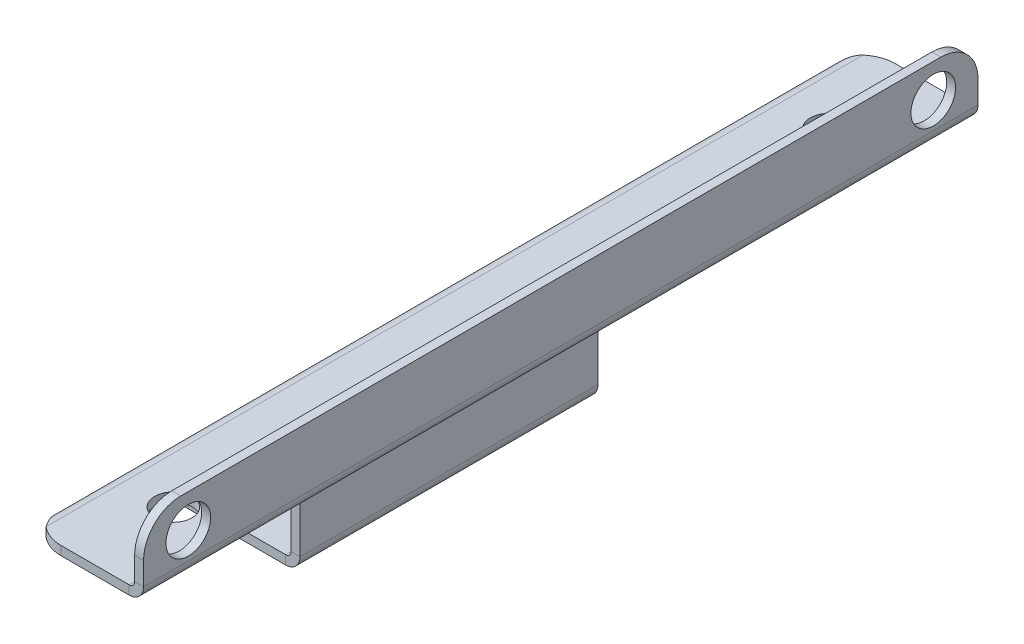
ISO-10303-21;
HEADER;
FILE_DESCRIPTION(('STEP AP214'),'2;1');
FILE_NAME('part.step','',(''),(''),'','','');
FILE_SCHEMA(('AUTOMOTIVE_DESIGN { 1 0 10303 214 1 1 1 1 }'));
ENDSEC;
DATA;
#1=APPLICATION_CONTEXT('core data for automotive mechanical design processes');
#2=APPLICATION_PROTOCOL_DEFINITION('international standard','automotive_design',2000,#1);
#3=PRODUCT_CONTEXT('',#1,'mechanical');
#4=PRODUCT('Part','Part','',(#3));
#5=PRODUCT_RELATED_PRODUCT_CATEGORY('part','',(#4));
#6=PRODUCT_DEFINITION_FORMATION('','',#4);
#7=PRODUCT_DEFINITION_CONTEXT('part definition',#1,'design');
#8=PRODUCT_DEFINITION('design','',#6,#7);
#9=PRODUCT_DEFINITION_SHAPE('','',#8);
#10=(LENGTH_UNIT() NAMED_UNIT(*) SI_UNIT(.MILLI.,.METRE.));
#11=(NAMED_UNIT(*) PLANE_ANGLE_UNIT() SI_UNIT($,.RADIAN.));
#12=(NAMED_UNIT(*) SI_UNIT($,.STERADIAN.) SOLID_ANGLE_UNIT());
#13=UNCERTAINTY_MEASURE_WITH_UNIT(LENGTH_MEASURE(1.E-05),#10,'distance_accuracy_value','');
#14=(GEOMETRIC_REPRESENTATION_CONTEXT(3) GLOBAL_UNCERTAINTY_ASSIGNED_CONTEXT((#13)) GLOBAL_UNIT_ASSIGNED_CONTEXT((#10,
#11,#12)) REPRESENTATION_CONTEXT('',''));
#15=CARTESIAN_POINT('',(0.,0.,0.));
#16=DIRECTION('',(0.,0.,1.));
#17=DIRECTION('',(1.,0.,0.));
#18=AXIS2_PLACEMENT_3D('',#15,#16,#17);
#19=CARTESIAN_POINT('',(-14.2634,-10.7366,112.));
#20=DIRECTION('',(0.,0.,-1.));
#21=DIRECTION('',(-1.,0.,0.));
#22=AXIS2_PLACEMENT_3D('',#19,#20,#21);
#23=CYLINDRICAL_SURFACE('',#22,0.7366);
#24=CARTESIAN_POINT('',(-14.2634,-10.,110.834397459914));
#25=CARTESIAN_POINT('',(-14.293165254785,-9.9999908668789,110.714978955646));
#26=CARTESIAN_POINT('',(-14.3229307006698,-10.0018038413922,110.595561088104));
#27=CARTESIAN_POINT('',(-14.3820315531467,-10.0090089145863,110.356723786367));
#28=CARTESIAN_POINT('',(-14.4113669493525,-10.0144010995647,110.237304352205));
#29=CARTESIAN_POINT('',(-14.4691629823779,-10.0286963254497,109.998519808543));
#30=CARTESIAN_POINT('',(-14.4976240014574,-10.037597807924,109.879154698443));
#31=CARTESIAN_POINT('',(-14.5532504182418,-10.0587709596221,109.640427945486));
#32=CARTESIAN_POINT('',(-14.5804158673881,-10.0710424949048,109.52106630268));
#33=CARTESIAN_POINT('',(-14.641863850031,-10.1034179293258,109.242425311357));
#34=CARTESIAN_POINT('',(-14.6754889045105,-10.1247687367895,109.083143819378));
#35=CARTESIAN_POINT('',(-14.7388671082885,-10.1726070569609,108.764594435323));
#36=CARTESIAN_POINT('',(-14.768620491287,-10.1990942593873,108.605326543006));
#37=CARTESIAN_POINT('',(-14.8236366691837,-10.2566976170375,108.285839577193));
#38=CARTESIAN_POINT('',(-14.8488715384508,-10.2878405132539,108.125620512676));
#39=CARTESIAN_POINT('',(-14.8939874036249,-10.3537833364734,107.805154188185));
#40=CARTESIAN_POINT('',(-14.9138675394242,-10.388583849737,107.644906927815));
#41=CARTESIAN_POINT('',(-14.930744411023,-10.4247811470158,107.48465643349));
#42=B_SPLINE_CURVE_WITH_KNOTS('',3,(#24,#25,#26,#27,#28,#29,#30,#31,#32,#33,#34,#35,#36,#37,#38,
#39,#40,#41),.UNSPECIFIED.,.F.,.F.,(4,2,2,2,2,2,2,2,4),(0.,0.369202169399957,0.738413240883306,
1.10746053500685,1.4764931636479,1.96892029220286,2.4613176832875,2.95666041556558,
3.45208266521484),.UNSPECIFIED.);
#43=CARTESIAN_POINT('',(-14.2634,-10.,110.834397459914));
#44=VERTEX_POINT('',#43);
#45=CARTESIAN_POINT('',(-14.930744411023,-10.4247811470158,107.48465643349));
#46=VERTEX_POINT('',#45);
#47=EDGE_CURVE('E411',#44,#46,#42,.T.);
#48=ORIENTED_EDGE('',*,*,#47,.T.);
#49=CARTESIAN_POINT('',(-14.930744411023,-10.4247811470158,107.48465643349));
#50=CARTESIAN_POINT('',(-14.9313540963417,-10.4260859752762,107.464462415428));
#51=CARTESIAN_POINT('',(-14.9319599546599,-10.4273925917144,107.444268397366));
#52=CARTESIAN_POINT('',(-14.9331639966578,-10.4300093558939,107.403880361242));
#53=CARTESIAN_POINT('',(-14.9337621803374,-10.4313195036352,107.38368634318));
#54=CARTESIAN_POINT('',(-14.9349508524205,-10.4339432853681,107.343298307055));
#55=CARTESIAN_POINT('',(-14.935541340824,-10.4352569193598,107.323104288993));
#56=CARTESIAN_POINT('',(-14.9367146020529,-10.4378876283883,107.282716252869));
#57=CARTESIAN_POINT('',(-14.9372973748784,-10.439204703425,107.262522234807));
#58=CARTESIAN_POINT('',(-14.9384551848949,-10.4418422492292,107.222134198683));
#59=CARTESIAN_POINT('',(-14.9390302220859,-10.4431627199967,107.201940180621));
#60=CARTESIAN_POINT('',(-14.9401725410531,-10.4458070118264,107.161552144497));
#61=CARTESIAN_POINT('',(-14.9407398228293,-10.4471308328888,107.141358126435));
#62=CARTESIAN_POINT('',(-14.9418666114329,-10.449781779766,107.10097009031));
#63=CARTESIAN_POINT('',(-14.9424261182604,-10.451108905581,107.080776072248));
#64=CARTESIAN_POINT('',(-14.9435373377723,-10.4537664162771,107.040388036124));
#65=CARTESIAN_POINT('',(-14.9440890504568,-10.4550968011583,107.020194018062));
#66=CARTESIAN_POINT('',(-14.9446368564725,-10.4564287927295,107.));
#67=B_SPLINE_CURVE_WITH_KNOTS('',3,(#49,#50,#51,#52,#53,#54,#55,#56,#57,#58,#59,#60,#61,#62,#63,
#64,#65,#66),.UNSPECIFIED.,.F.,.F.,(4,2,2,2,2,2,2,2,4),(0.,0.0607359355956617,0.121471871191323,
0.182207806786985,0.242943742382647,0.303679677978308,0.36441561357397,0.425151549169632,
0.485887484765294),.UNSPECIFIED.);
#68=CARTESIAN_POINT('',(-14.9446368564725,-10.4564287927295,107.));
#69=VERTEX_POINT('',#68);
#70=EDGE_CURVE('E403',#46,#69,#67,.T.);
#71=ORIENTED_EDGE('',*,*,#70,.T.);
#72=DIRECTION('',(0.,0.,-1.));
#73=VECTOR('',#72,1.);
#74=CARTESIAN_POINT('',(-14.9446368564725,-10.4564287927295,112.));
#75=LINE('',#74,#73);
#76=CARTESIAN_POINT('',(-14.9446368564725,-10.4564287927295,76.));
#77=VERTEX_POINT('',#76);
#78=EDGE_CURVE('E466',#77,#69,#75,.F.);
#79=ORIENTED_EDGE('',*,*,#78,.F.);
#80=CARTESIAN_POINT('',(-14.2634,-10.7366,76.));
#81=DIRECTION('',(0.,0.,-1.));
#82=DIRECTION('',(-1.,0.,0.));
#83=AXIS2_PLACEMENT_3D('',#80,#81,#82);
#84=CIRCLE('',#83,0.7366);
#85=CARTESIAN_POINT('',(-15.,-10.7366,76.));
#86=VERTEX_POINT('',#85);
#87=EDGE_CURVE('E475',#86,#77,#84,.T.);
#88=ORIENTED_EDGE('',*,*,#87,.F.);
#89=DIRECTION('',(0.,0.,-1.));
#90=VECTOR('',#89,1.);
#91=CARTESIAN_POINT('',(-15.,-10.7366,112.));
#92=LINE('',#91,#90);
#93=CARTESIAN_POINT('',(-15.,-10.7366,36.));
#94=VERTEX_POINT('',#93);
#95=EDGE_CURVE('E304',#86,#94,#92,.T.);
#96=ORIENTED_EDGE('',*,*,#95,.T.);
#97=CARTESIAN_POINT('',(-14.2634,-10.7366,36.));
#98=DIRECTION('',(0.,0.,-1.));
#99=DIRECTION('',(-1.,0.,0.));
#100=AXIS2_PLACEMENT_3D('',#97,#98,#99);
#101=CIRCLE('',#100,0.7366);
#102=CARTESIAN_POINT('',(-14.9446368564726,-10.4564287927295,36.));
#103=VERTEX_POINT('',#102);
#104=EDGE_CURVE('E764',#103,#94,#101,.F.);
#105=ORIENTED_EDGE('',*,*,#104,.F.);
#106=DIRECTION('',(0.,0.,-1.));
#107=VECTOR('',#106,1.);
#108=CARTESIAN_POINT('',(-14.9446368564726,-10.4564287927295,112.));
#109=LINE('',#108,#107);
#110=CARTESIAN_POINT('',(-14.9446368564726,-10.4564287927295,5.00000000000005));
#111=VERTEX_POINT('',#110);
#112=EDGE_CURVE('E543',#111,#103,#109,.F.);
#113=ORIENTED_EDGE('',*,*,#112,.F.);
#114=CARTESIAN_POINT('',(-14.9446368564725,-10.4564287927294,5.00000000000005));
#115=CARTESIAN_POINT('',(-14.9426636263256,-10.4516465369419,4.91813903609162));
#116=CARTESIAN_POINT('',(-14.9403137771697,-10.4460609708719,4.83633454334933));
#117=CARTESIAN_POINT('',(-14.934733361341,-10.4333815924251,4.6728700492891));
#118=CARTESIAN_POINT('',(-14.9315027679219,-10.4262877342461,4.591210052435));
#119=CARTESIAN_POINT('',(-14.9240334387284,-10.4106903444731,4.4280699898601));
#120=CARTESIAN_POINT('',(-14.9197946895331,-10.4021867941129,4.34658992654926));
#121=CARTESIAN_POINT('',(-14.9101434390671,-10.3838820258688,4.18376126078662));
#122=CARTESIAN_POINT('',(-14.9047297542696,-10.3740795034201,4.1024128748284));
#123=CARTESIAN_POINT('',(-14.892535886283,-10.3533086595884,3.93996979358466));
#124=CARTESIAN_POINT('',(-14.8857557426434,-10.3423403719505,3.85887509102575));
#125=CARTESIAN_POINT('',(-14.8706638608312,-10.3194695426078,3.69696266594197));
#126=CARTESIAN_POINT('',(-14.8623521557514,-10.3075670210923,3.61614493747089));
#127=CARTESIAN_POINT('',(-14.8418134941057,-10.2801149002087,3.43532841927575));
#128=CARTESIAN_POINT('',(-14.8291257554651,-10.2643785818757,3.3354096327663));
#129=CARTESIAN_POINT('',(-14.8007312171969,-10.2323053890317,3.13609808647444));
#130=CARTESIAN_POINT('',(-14.7850244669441,-10.2159685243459,3.0367053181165));
#131=CARTESIAN_POINT('',(-14.7503030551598,-10.1833644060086,2.83863886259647));
#132=CARTESIAN_POINT('',(-14.7312932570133,-10.1670970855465,2.73996433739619));
#133=CARTESIAN_POINT('',(-14.689863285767,-10.1354430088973,2.54318537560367));
#134=CARTESIAN_POINT('',(-14.6674430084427,-10.1200562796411,2.44508095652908));
#135=CARTESIAN_POINT('',(-14.6185737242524,-10.0906428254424,2.24763156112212));
#136=CARTESIAN_POINT('',(-14.5920558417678,-10.0766477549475,2.14829876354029));
#137=CARTESIAN_POINT('',(-14.535258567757,-10.0513010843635,1.95038434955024));
#138=CARTESIAN_POINT('',(-14.5049797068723,-10.0399491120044,1.85180262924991));
#139=CARTESIAN_POINT('',(-14.4410633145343,-10.0209642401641,1.65488419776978));
#140=CARTESIAN_POINT('',(-14.4074117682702,-10.0133477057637,1.55655040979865));
#141=CARTESIAN_POINT('',(-14.3373466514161,-10.0028648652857,1.36054761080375));
#142=CARTESIAN_POINT('',(-14.3009312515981,-10.0000017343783,1.26287908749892));
#143=CARTESIAN_POINT('',(-14.2634,-10.,1.16560254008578));
#144=B_SPLINE_CURVE_WITH_KNOTS('',3,(#114,#115,#116,#117,#118,#119,#120,#121,#122,#123,#124,
#125,#126,#127,#128,#129,#130,#131,#132,#133,#134,#135,#136,#137,#138,#139,#140,#141,#142,#143),
.UNSPECIFIED.,.F.,.F.,(4,2,2,2,2,2,2,2,2,2,2,2,2,2,4),(0.,0.246067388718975,0.492142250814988,
0.738220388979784,0.984547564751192,1.23086761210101,1.47718233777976,1.78296665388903,
2.08874596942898,2.39407881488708,2.69942099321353,3.01060541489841,3.32174598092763,
3.63423775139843,3.94693817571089),.UNSPECIFIED.);
#145=CARTESIAN_POINT('',(-14.2634,-10.,1.16560254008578));
#146=VERTEX_POINT('',#145);
#147=EDGE_CURVE('E65',#111,#146,#144,.T.);
#148=ORIENTED_EDGE('',*,*,#147,.T.);
#149=DIRECTION('',(0.,0.,-1.));
#150=VECTOR('',#149,1.);
#151=CARTESIAN_POINT('',(-14.2634,-10.,112.));
#152=LINE('',#151,#150);
#153=EDGE_CURVE('E301',#44,#146,#152,.T.);
#154=ORIENTED_EDGE('',*,*,#153,.F.);
#155=EDGE_LOOP('',(#48,#71,#79,#88,#96,#105,#113,#148,#154));
#156=FACE_BOUND('',#155,.T.);
#157=ADVANCED_FACE('F40',(#156),#23,.F.);
#158=CARTESIAN_POINT('',(-14.2634,-10.7366,112.));
#159=DIRECTION('',(0.,0.,-1.));
#160=DIRECTION('',(-1.,0.,0.));
#161=AXIS2_PLACEMENT_3D('',#158,#159,#160);
#162=CYLINDRICAL_SURFACE('',#161,1.9366);
#163=CARTESIAN_POINT('',(-16.0179196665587,-9.91679496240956,107.48465643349));
#164=CARTESIAN_POINT('',(-16.0195225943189,-9.92022549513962,107.464462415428));
#165=CARTESIAN_POINT('',(-16.0211154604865,-9.92366072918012,107.444268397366));
#166=CARTESIAN_POINT('',(-16.024281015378,-9.93054048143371,107.403880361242));
#167=CARTESIAN_POINT('',(-16.0258537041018,-9.93398499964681,107.38368634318));
#168=CARTESIAN_POINT('',(-16.0289788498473,-9.94088320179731,107.343298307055));
#169=CARTESIAN_POINT('',(-16.030531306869,-9.94433688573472,107.323104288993));
#170=CARTESIAN_POINT('',(-16.0336159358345,-9.95125330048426,107.282716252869));
#171=CARTESIAN_POINT('',(-16.0351481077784,-9.95471603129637,107.262522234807));
#172=CARTESIAN_POINT('',(-16.0381921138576,-9.96165042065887,107.222134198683));
#173=CARTESIAN_POINT('',(-16.0397039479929,-9.96512207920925,107.201940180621));
#174=CARTESIAN_POINT('',(-16.0427072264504,-9.97207420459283,107.161552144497));
#175=CARTESIAN_POINT('',(-16.0441986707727,-9.97555467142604,107.141358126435));
#176=CARTESIAN_POINT('',(-16.0471611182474,-9.98252429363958,107.10097009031));
#177=CARTESIAN_POINT('',(-16.0486321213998,-9.98601344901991,107.080776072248));
#178=CARTESIAN_POINT('',(-16.0515536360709,-9.99300032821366,107.040388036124));
#179=CARTESIAN_POINT('',(-16.0530041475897,-9.99649805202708,107.020194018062));
#180=CARTESIAN_POINT('',(-16.0544443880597,-10.,107.));
#181=B_SPLINE_CURVE_WITH_KNOTS('',3,(#163,#164,#165,#166,#167,#168,#169,#170,#171,#172,#173,
#174,#175,#176,#177,#178,#179,#180),.UNSPECIFIED.,.F.,.F.,(4,2,2,2,2,2,2,2,4),(0.,
0.0616378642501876,0.123275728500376,0.184913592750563,0.246551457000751,0.308189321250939,
0.369827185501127,0.431465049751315,0.493102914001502),.UNSPECIFIED.);
#182=CARTESIAN_POINT('',(-16.0179196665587,-9.91679496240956,107.48465643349));
#183=VERTEX_POINT('',#182);
#184=CARTESIAN_POINT('',(-16.0544443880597,-10.,107.));
#185=VERTEX_POINT('',#184);
#186=EDGE_CURVE('E57',#183,#185,#181,.T.);
#187=ORIENTED_EDGE('',*,*,#186,.F.);
#188=CARTESIAN_POINT('',(-14.2634,-8.8,110.834397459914));
#189=CARTESIAN_POINT('',(-14.3124855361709,-8.79999879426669,110.759502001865));
#190=CARTESIAN_POINT('',(-14.3615613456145,-8.80186688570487,110.684612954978));
#191=CARTESIAN_POINT('',(-14.4594296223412,-8.80932199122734,110.534836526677));
#192=CARTESIAN_POINT('',(-14.5082220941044,-8.81490894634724,110.459949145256));
#193=CARTESIAN_POINT('',(-14.6536863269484,-8.83720417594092,110.235415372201));
#194=CARTESIAN_POINT('',(-14.7495417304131,-8.85944689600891,110.085751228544));
#195=CARTESIAN_POINT('',(-14.9367239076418,-8.91817227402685,109.786485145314));
#196=CARTESIAN_POINT('',(-15.0280521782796,-8.95465018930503,109.636883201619));
#197=CARTESIAN_POINT('',(-15.2041618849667,-9.04101604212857,109.337603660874));
#198=CARTESIAN_POINT('',(-15.2889409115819,-9.09090888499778,109.187926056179));
#199=CARTESIAN_POINT('',(-15.4389827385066,-9.19530033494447,108.909000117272));
#200=CARTESIAN_POINT('',(-15.505330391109,-9.24824321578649,108.779749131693));
#201=CARTESIAN_POINT('',(-15.6305684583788,-9.36239125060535,108.521221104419));
#202=CARTESIAN_POINT('',(-15.689456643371,-9.42359886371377,108.391944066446));
#203=CARTESIAN_POINT('',(-15.7988647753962,-9.55339017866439,108.132992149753));
#204=CARTESIAN_POINT('',(-15.8493587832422,-9.62199570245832,108.003317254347));
#205=CARTESIAN_POINT('',(-15.940916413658,-9.76520145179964,107.743982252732));
#206=CARTESIAN_POINT('',(-15.9819817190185,-9.83980060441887,107.614322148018));
#207=CARTESIAN_POINT('',(-16.0179196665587,-9.91679496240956,107.48465643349));
#208=B_SPLINE_CURVE_WITH_KNOTS('',3,(#188,#189,#190,#191,#192,#193,#194,#195,#196,#197,#198,
#199,#200,#201,#202,#203,#204,#205,#206,#207),.UNSPECIFIED.,.F.,.F.,(4,2,2,2,2,2,2,2,2,4),(0.,
0.268601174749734,0.537198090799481,1.07386770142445,1.61035866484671,2.14704606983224,
2.61055153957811,3.07419522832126,3.53924603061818,4.00421376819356),.UNSPECIFIED.);
#209=CARTESIAN_POINT('',(-14.2634,-8.8,110.834397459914));
#210=VERTEX_POINT('',#209);
#211=EDGE_CURVE('E430',#210,#183,#208,.T.);
#212=ORIENTED_EDGE('',*,*,#211,.F.);
#213=DIRECTION('',(0.,0.,-1.));
#214=VECTOR('',#213,1.);
#215=CARTESIAN_POINT('',(-14.2634,-8.8,112.));
#216=LINE('',#215,#214);
#217=CARTESIAN_POINT('',(-14.2634,-8.8,1.16560254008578));
#218=VERTEX_POINT('',#217);
#219=EDGE_CURVE('E245',#210,#218,#216,.T.);
#220=ORIENTED_EDGE('',*,*,#219,.T.);
#221=CARTESIAN_POINT('',(-16.0544443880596,-9.99999999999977,5.00000000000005));
#222=CARTESIAN_POINT('',(-16.0486900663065,-9.98604772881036,4.90911741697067));
#223=CARTESIAN_POINT('',(-16.0417287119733,-9.96954488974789,4.81872036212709));
#224=CARTESIAN_POINT('',(-16.0250772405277,-9.93202027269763,4.63923051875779));
#225=CARTESIAN_POINT('',(-16.0153902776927,-9.91100372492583,4.55013634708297));
#226=CARTESIAN_POINT('',(-15.9929646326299,-9.86500634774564,4.37340263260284));
#227=CARTESIAN_POINT('',(-15.9802269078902,-9.84002676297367,4.28576264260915));
#228=CARTESIAN_POINT('',(-15.9513181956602,-9.78672014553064,4.1121248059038));
#229=CARTESIAN_POINT('',(-15.9351486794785,-9.75839454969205,4.0261262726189));
#230=CARTESIAN_POINT('',(-15.8989869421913,-9.69906505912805,3.85586152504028));
#231=CARTESIAN_POINT('',(-15.8789941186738,-9.66806074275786,3.77159558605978));
#232=CARTESIAN_POINT('',(-15.8349385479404,-9.60426134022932,3.60482268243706));
#233=CARTESIAN_POINT('',(-15.8108755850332,-9.57146615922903,3.52231581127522));
#234=CARTESIAN_POINT('',(-15.7575168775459,-9.50373560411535,3.35631387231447));
#235=CARTESIAN_POINT('',(-15.728070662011,-9.46876538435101,3.27288106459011));
#236=CARTESIAN_POINT('',(-15.6802372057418,-9.41616283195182,3.14922345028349));
#237=CARTESIAN_POINT('',(-15.6636814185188,-9.39860352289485,3.10825150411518));
#238=CARTESIAN_POINT('',(-15.6293105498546,-9.36353391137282,3.02681810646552));
#239=CARTESIAN_POINT('',(-15.6114954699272,-9.34602360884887,2.98635665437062));
#240=CARTESIAN_POINT('',(-15.5561721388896,-9.29377958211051,2.86569217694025));
#241=CARTESIAN_POINT('',(-15.5167878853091,-9.25933507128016,2.78621442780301));
#242=CARTESIAN_POINT('',(-15.4333464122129,-9.19242004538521,2.62950413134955));
#243=CARTESIAN_POINT('',(-15.3893144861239,-9.15994021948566,2.55226207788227));
#244=CARTESIAN_POINT('',(-15.2965476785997,-9.09765271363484,2.39954837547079));
#245=CARTESIAN_POINT('',(-15.2478132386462,-9.06784478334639,2.32407656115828));
#246=CARTESIAN_POINT('',(-15.1457826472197,-9.01172127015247,2.17496806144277));
#247=CARTESIAN_POINT('',(-15.0924881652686,-8.98540441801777,2.10133071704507));
#248=CARTESIAN_POINT('',(-14.9990584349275,-8.94468870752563,1.97869556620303));
#249=CARTESIAN_POINT('',(-14.9600442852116,-8.9291419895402,1.92921967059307));
#250=CARTESIAN_POINT('',(-14.8802546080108,-8.90037870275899,1.83102676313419));
#251=CARTESIAN_POINT('',(-14.8394793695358,-8.88716175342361,1.7823096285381));
#252=CARTESIAN_POINT('',(-14.7563689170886,-8.86329544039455,1.68559868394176));
#253=CARTESIAN_POINT('',(-14.7140340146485,-8.85264556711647,1.63760473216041));
#254=CARTESIAN_POINT('',(-14.6275171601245,-8.83401788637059,1.54176657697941));
#255=CARTESIAN_POINT('',(-14.5833197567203,-8.82607158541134,1.49393017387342));
#256=CARTESIAN_POINT('',(-14.4937322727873,-8.81321384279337,1.39894436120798));
#257=CARTESIAN_POINT('',(-14.4483418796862,-8.808303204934,1.35179513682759));
#258=CARTESIAN_POINT('',(-14.3565590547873,-8.80169370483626,1.25817476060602));
#259=CARTESIAN_POINT('',(-14.3101657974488,-8.79999759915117,1.21170422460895));
#260=CARTESIAN_POINT('',(-14.2634,-8.8,1.16560254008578));
#261=B_SPLINE_CURVE_WITH_KNOTS('',3,(#221,#222,#223,#224,#225,#226,#227,#228,#229,#230,#231,
#232,#233,#234,#235,#236,#237,#238,#239,#240,#241,#242,#243,#244,#245,#246,#247,#248,#249,#250,
#251,#252,#253,#254,#255,#256,#257,#258,#259,#260),.UNSPECIFIED.,.F.,.F.,(4,2,2,2,2,2,2,2,2,2,2,
2,2,2,2,2,2,2,2,4),(0.,0.276312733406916,0.552307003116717,0.828214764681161,1.10400447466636,
1.37983767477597,1.65568549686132,1.94094078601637,2.08357794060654,2.22621492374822,
2.51150758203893,2.79532070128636,3.0791072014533,3.36279024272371,3.55741811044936,
3.75201415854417,3.94657154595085,4.1433242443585,4.34012901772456,4.5371024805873),.UNSPECIFIED.);
#262=CARTESIAN_POINT('',(-16.0544443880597,-10.,5.00000000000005));
#263=VERTEX_POINT('',#262);
#264=EDGE_CURVE('E545',#263,#218,#261,.T.);
#265=ORIENTED_EDGE('',*,*,#264,.F.);
#266=DIRECTION('',(0.,0.,-1.));
#267=VECTOR('',#266,1.);
#268=CARTESIAN_POINT('',(-16.0544443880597,-10.,112.));
#269=LINE('',#268,#267);
#270=CARTESIAN_POINT('',(-16.0544443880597,-10.,36.));
#271=VERTEX_POINT('',#270);
#272=EDGE_CURVE('E757',#263,#271,#269,.F.);
#273=ORIENTED_EDGE('',*,*,#272,.T.);
#274=CARTESIAN_POINT('',(-14.2634,-10.7366,36.));
#275=DIRECTION('',(0.,0.,1.));
#276=DIRECTION('',(1.,0.,0.));
#277=AXIS2_PLACEMENT_3D('',#274,#275,#276);
#278=CIRCLE('',#277,1.9366);
#279=CARTESIAN_POINT('',(-16.2,-10.7366,36.));
#280=VERTEX_POINT('',#279);
#281=EDGE_CURVE('E765',#271,#280,#278,.T.);
#282=ORIENTED_EDGE('',*,*,#281,.T.);
#283=DIRECTION('',(0.,0.,-1.));
#284=VECTOR('',#283,1.);
#285=CARTESIAN_POINT('',(-16.2,-10.7366,112.));
#286=LINE('',#285,#284);
#287=CARTESIAN_POINT('',(-16.2,-10.7366,76.));
#288=VERTEX_POINT('',#287);
#289=EDGE_CURVE('E280',#288,#280,#286,.T.);
#290=ORIENTED_EDGE('',*,*,#289,.F.);
#291=CARTESIAN_POINT('',(-14.2634,-10.7366,76.));
#292=DIRECTION('',(0.,0.,-1.));
#293=DIRECTION('',(-1.,0.,0.));
#294=AXIS2_PLACEMENT_3D('',#291,#292,#293);
#295=CIRCLE('',#294,1.9366);
#296=CARTESIAN_POINT('',(-16.0544443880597,-10.,76.));
#297=VERTEX_POINT('',#296);
#298=EDGE_CURVE('E476',#288,#297,#295,.T.);
#299=ORIENTED_EDGE('',*,*,#298,.T.);
#300=DIRECTION('',(0.,0.,-1.));
#301=VECTOR('',#300,1.);
#302=CARTESIAN_POINT('',(-16.0544443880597,-10.,112.));
#303=LINE('',#302,#301);
#304=EDGE_CURVE('E480',#297,#185,#303,.F.);
#305=ORIENTED_EDGE('',*,*,#304,.T.);
#306=EDGE_LOOP('',(#187,#212,#220,#265,#273,#282,#290,#299,#305));
#307=FACE_BOUND('',#306,.T.);
#308=ADVANCED_FACE('F582',(#307),#162,.T.);
#309=CARTESIAN_POINT('',(-1.2,-8.0634,112.));
#310=DIRECTION('',(0.,0.,1.));
#311=DIRECTION('',(1.,0.,0.));
#312=AXIS2_PLACEMENT_3D('',#309,#310,#311);
#313=PLANE('',#312);
#314=DIRECTION('',(-1.,0.,0.));
#315=VECTOR('',#314,1.);
#316=CARTESIAN_POINT('',(0.,-8.8,112.));
#317=LINE('',#316,#315);
#318=CARTESIAN_POINT('',(-1.9366,-8.8,112.));
#319=VERTEX_POINT('',#318);
#320=CARTESIAN_POINT('',(-11.0544443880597,-8.8,112.));
#321=VERTEX_POINT('',#320);
#322=EDGE_CURVE('E242',#319,#321,#317,.T.);
#323=ORIENTED_EDGE('',*,*,#322,.T.);
#324=DIRECTION('',(0.,-1.,0.));
#325=VECTOR('',#324,1.);
#326=CARTESIAN_POINT('',(-11.0544443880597,-8.8,112.));
#327=LINE('',#326,#325);
#328=CARTESIAN_POINT('',(-11.0544443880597,-10.,112.));
#329=VERTEX_POINT('',#328);
#330=EDGE_CURVE('E223',#329,#321,#327,.F.);
#331=ORIENTED_EDGE('',*,*,#330,.F.);
#332=DIRECTION('',(-1.,0.,0.));
#333=VECTOR('',#332,1.);
#334=CARTESIAN_POINT('',(0.,-10.,112.));
#335=LINE('',#334,#333);
#336=CARTESIAN_POINT('',(-1.9366,-10.,112.));
#337=VERTEX_POINT('',#336);
#338=EDGE_CURVE('E276',#337,#329,#335,.T.);
#339=ORIENTED_EDGE('',*,*,#338,.F.);
#340=DIRECTION('',(0.,1.,0.));
#341=VECTOR('',#340,1.);
#342=CARTESIAN_POINT('',(-1.9366,-10.,112.));
#343=LINE('',#342,#341);
#344=EDGE_CURVE('E248',#337,#319,#343,.T.);
#345=ORIENTED_EDGE('',*,*,#344,.T.);
#346=EDGE_LOOP('',(#323,#331,#339,#345));
#347=FACE_BOUND('',#346,.T.);
#348=ADVANCED_FACE('F247',(#347),#313,.T.);
#349=CARTESIAN_POINT('',(0.,-10.,112.));
#350=DIRECTION('',(0.,-1.,0.));
#351=DIRECTION('',(1.,0.,0.));
#352=AXIS2_PLACEMENT_3D('',#349,#350,#351);
#353=PLANE('',#352);
#354=CARTESIAN_POINT('',(-8.,-9.99999999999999,12.));
#355=DIRECTION('',(0.,-1.,0.));
#356=DIRECTION('',(1.,0.,0.));
#357=AXIS2_PLACEMENT_3D('',#354,#355,#356);
#358=CIRCLE('',#357,2.5);
#359=CARTESIAN_POINT('',(-5.5,-9.99999999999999,12.));
#360=VERTEX_POINT('',#359);
#361=EDGE_CURVE('E394',#360,#360,#358,.T.);
#362=ORIENTED_EDGE('',*,*,#361,.F.);
#363=EDGE_LOOP('',(#362));
#364=FACE_BOUND('',#363,.T.);
#365=CARTESIAN_POINT('',(-8.,-9.99999999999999,100.));
#366=DIRECTION('',(0.,-1.,0.));
#367=DIRECTION('',(1.,0.,0.));
#368=AXIS2_PLACEMENT_3D('',#365,#366,#367);
#369=CIRCLE('',#368,2.5);
#370=CARTESIAN_POINT('',(-5.5,-9.99999999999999,100.));
#371=VERTEX_POINT('',#370);
#372=EDGE_CURVE('E391',#371,#371,#369,.T.);
#373=ORIENTED_EDGE('',*,*,#372,.F.);
#374=EDGE_LOOP('',(#373));
#375=FACE_BOUND('',#374,.T.);
#376=ORIENTED_EDGE('',*,*,#338,.T.);
#377=CARTESIAN_POINT('',(-11.0544443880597,-10.,107.));
#378=DIRECTION('',(0.,1.,0.));
#379=DIRECTION('',(-1.,0.,0.));
#380=AXIS2_PLACEMENT_3D('',#377,#378,#379);
#381=CIRCLE('',#380,5.);
#382=EDGE_CURVE('E230',#44,#329,#381,.T.);
#383=ORIENTED_EDGE('',*,*,#382,.F.);
#384=ORIENTED_EDGE('',*,*,#153,.T.);
#385=CARTESIAN_POINT('',(-11.0544443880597,-10.,5.));
#386=DIRECTION('',(0.,1.,0.));
#387=DIRECTION('',(-1.,0.,0.));
#388=AXIS2_PLACEMENT_3D('',#385,#386,#387);
#389=CIRCLE('',#388,5.);
#390=CARTESIAN_POINT('',(-11.0544443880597,-10.,0.));
#391=VERTEX_POINT('',#390);
#392=EDGE_CURVE('E401',#391,#146,#389,.T.);
#393=ORIENTED_EDGE('',*,*,#392,.F.);
#394=DIRECTION('',(-1.,0.,0.));
#395=VECTOR('',#394,1.);
#396=CARTESIAN_POINT('',(0.,-10.,0.));
#397=LINE('',#396,#395);
#398=CARTESIAN_POINT('',(-1.9366,-10.,0.));
#399=VERTEX_POINT('',#398);
#400=EDGE_CURVE('E260',#399,#391,#397,.T.);
#401=ORIENTED_EDGE('',*,*,#400,.F.);
#402=DIRECTION('',(0.,0.,-1.));
#403=VECTOR('',#402,1.);
#404=CARTESIAN_POINT('',(-1.9366,-10.,112.));
#405=LINE('',#404,#403);
#406=EDGE_CURVE('E298',#337,#399,#405,.T.);
#407=ORIENTED_EDGE('',*,*,#406,.F.);
#408=EDGE_LOOP('',(#376,#383,#384,#393,#401,#407));
#409=FACE_BOUND('',#408,.T.);
#410=ADVANCED_FACE('F539',(#364,#375,#409),#353,.T.);
#411=CARTESIAN_POINT('',(0.,-8.8,112.));
#412=DIRECTION('',(0.,-1.,0.));
#413=DIRECTION('',(1.,0.,0.));
#414=AXIS2_PLACEMENT_3D('',#411,#412,#413);
#415=PLANE('',#414);
#416=CARTESIAN_POINT('',(-8.,-8.8,12.));
#417=DIRECTION('',(0.,1.,0.));
#418=DIRECTION('',(-1.,0.,0.));
#419=AXIS2_PLACEMENT_3D('',#416,#417,#418);
#420=CIRCLE('',#419,2.5);
#421=CARTESIAN_POINT('',(-10.5,-8.8,12.));
#422=VERTEX_POINT('',#421);
#423=EDGE_CURVE('E364',#422,#422,#420,.T.);
#424=ORIENTED_EDGE('',*,*,#423,.F.);
#425=EDGE_LOOP('',(#424));
#426=FACE_BOUND('',#425,.T.);
#427=CARTESIAN_POINT('',(-8.,-8.8,100.));
#428=DIRECTION('',(0.,1.,0.));
#429=DIRECTION('',(-1.,0.,0.));
#430=AXIS2_PLACEMENT_3D('',#427,#428,#429);
#431=CIRCLE('',#430,2.5);
#432=CARTESIAN_POINT('',(-10.5,-8.8,100.));
#433=VERTEX_POINT('',#432);
#434=EDGE_CURVE('E374',#433,#433,#431,.T.);
#435=ORIENTED_EDGE('',*,*,#434,.F.);
#436=EDGE_LOOP('',(#435));
#437=FACE_BOUND('',#436,.T.);
#438=CARTESIAN_POINT('',(-11.0544443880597,-8.8,107.));
#439=DIRECTION('',(0.,1.,0.));
#440=DIRECTION('',(-1.,0.,0.));
#441=AXIS2_PLACEMENT_3D('',#438,#439,#440);
#442=CIRCLE('',#441,5.);
#443=EDGE_CURVE('E227',#210,#321,#442,.T.);
#444=ORIENTED_EDGE('',*,*,#443,.T.);
#445=ORIENTED_EDGE('',*,*,#322,.F.);
#446=DIRECTION('',(0.,0.,-1.));
#447=VECTOR('',#446,1.);
#448=CARTESIAN_POINT('',(-1.9366,-8.8,112.));
#449=LINE('',#448,#447);
#450=CARTESIAN_POINT('',(-1.9366,-8.8,0.));
#451=VERTEX_POINT('',#450);
#452=EDGE_CURVE('E284',#319,#451,#449,.T.);
#453=ORIENTED_EDGE('',*,*,#452,.T.);
#454=DIRECTION('',(-1.,0.,0.));
#455=VECTOR('',#454,1.);
#456=CARTESIAN_POINT('',(0.,-8.8,0.));
#457=LINE('',#456,#455);
#458=CARTESIAN_POINT('',(-11.0544443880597,-8.8,0.));
#459=VERTEX_POINT('',#458);
#460=EDGE_CURVE('E274',#451,#459,#457,.T.);
#461=ORIENTED_EDGE('',*,*,#460,.T.);
#462=CARTESIAN_POINT('',(-11.0544443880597,-8.8,5.));
#463=DIRECTION('',(0.,1.,0.));
#464=DIRECTION('',(-1.,0.,0.));
#465=AXIS2_PLACEMENT_3D('',#462,#463,#464);
#466=CIRCLE('',#465,5.);
#467=EDGE_CURVE('E398',#459,#218,#466,.T.);
#468=ORIENTED_EDGE('',*,*,#467,.T.);
#469=ORIENTED_EDGE('',*,*,#219,.F.);
#470=EDGE_LOOP('',(#444,#445,#453,#461,#468,#469));
#471=FACE_BOUND('',#470,.T.);
#472=ADVANCED_FACE('F240',(#426,#437,#471),#415,.F.);
#473=CARTESIAN_POINT('',(-16.0544443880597,-10.,94.));
#474=DIRECTION('',(0.380357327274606,0.924839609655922,0.));
#475=DIRECTION('',(0.,0.,-1.));
#476=AXIS2_PLACEMENT_3D('',#473,#474,#475);
#477=PLANE('',#476);
#478=ORIENTED_EDGE('',*,*,#78,.T.);
#479=DIRECTION('',(-0.924839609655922,0.380357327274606,0.));
#480=VECTOR('',#479,1.);
#481=CARTESIAN_POINT('',(-16.0544443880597,-10.,107.));
#482=LINE('',#481,#480);
#483=EDGE_CURVE('E410',#185,#69,#482,.F.);
#484=ORIENTED_EDGE('',*,*,#483,.F.);
#485=ORIENTED_EDGE('',*,*,#304,.F.);
#486=DIRECTION('',(-0.924839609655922,0.380357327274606,0.));
#487=VECTOR('',#486,1.);
#488=CARTESIAN_POINT('',(-16.0544443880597,-10.,76.));
#489=LINE('',#488,#487);
#490=EDGE_CURVE('E474',#297,#77,#489,.F.);
#491=ORIENTED_EDGE('',*,*,#490,.T.);
#492=EDGE_LOOP('',(#478,#484,#485,#491));
#493=FACE_BOUND('',#492,.T.);
#494=ADVANCED_FACE('F471',(#493),#477,.F.);
#495=CARTESIAN_POINT('',(-16.0544443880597,-10.,18.));
#496=DIRECTION('',(0.380357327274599,0.924839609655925,0.));
#497=DIRECTION('',(0.,0.,-1.));
#498=AXIS2_PLACEMENT_3D('',#495,#496,#497);
#499=PLANE('',#498);
#500=ORIENTED_EDGE('',*,*,#272,.F.);
#501=DIRECTION('',(-0.924839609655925,0.380357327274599,0.));
#502=VECTOR('',#501,1.);
#503=CARTESIAN_POINT('',(-16.0544443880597,-10.,5.00000000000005));
#504=LINE('',#503,#502);
#505=EDGE_CURVE('E548',#263,#111,#504,.F.);
#506=ORIENTED_EDGE('',*,*,#505,.T.);
#507=ORIENTED_EDGE('',*,*,#112,.T.);
#508=DIRECTION('',(-0.924839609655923,0.380357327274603,0.));
#509=VECTOR('',#508,1.);
#510=CARTESIAN_POINT('',(-16.0544443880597,-10.,36.));
#511=LINE('',#510,#509);
#512=EDGE_CURVE('E767',#271,#103,#511,.F.);
#513=ORIENTED_EDGE('',*,*,#512,.F.);
#514=EDGE_LOOP('',(#500,#506,#507,#513));
#515=FACE_BOUND('',#514,.T.);
#516=ADVANCED_FACE('F612',(#515),#499,.F.);
#517=CARTESIAN_POINT('',(-15.,-30.8,112.));
#518=DIRECTION('',(0.,-1.,0.));
#519=DIRECTION('',(1.,0.,0.));
#520=AXIS2_PLACEMENT_3D('',#517,#518,#519);
#521=PLANE('',#520);
#522=CARTESIAN_POINT('',(-24.9366,-30.8,65.18));
#523=DIRECTION('',(0.,-1.,0.));
#524=DIRECTION('',(1.,0.,0.));
#525=AXIS2_PLACEMENT_3D('',#522,#523,#524);
#526=CIRCLE('',#525,2.5);
#527=CARTESIAN_POINT('',(-22.4366,-30.8,65.18));
#528=VERTEX_POINT('',#527);
#529=EDGE_CURVE('E367',#528,#528,#526,.T.);
#530=ORIENTED_EDGE('',*,*,#529,.T.);
#531=EDGE_LOOP('',(#530));
#532=FACE_BOUND('',#531,.T.);
#533=CARTESIAN_POINT('',(-24.9366,-30.8,46.82));
#534=DIRECTION('',(0.,-1.,0.));
#535=DIRECTION('',(1.,0.,0.));
#536=AXIS2_PLACEMENT_3D('',#533,#534,#535);
#537=CIRCLE('',#536,2.5);
#538=CARTESIAN_POINT('',(-22.4366,-30.8,46.82));
#539=VERTEX_POINT('',#538);
#540=EDGE_CURVE('E363',#539,#539,#537,.T.);
#541=ORIENTED_EDGE('',*,*,#540,.T.);
#542=EDGE_LOOP('',(#541));
#543=FACE_BOUND('',#542,.T.);
#544=DIRECTION('',(-1.,0.,0.));
#545=VECTOR('',#544,1.);
#546=CARTESIAN_POINT('',(-25.9683,-30.8,36.));
#547=LINE('',#546,#545);
#548=CARTESIAN_POINT('',(-30.,-30.8,36.));
#549=VERTEX_POINT('',#548);
#550=CARTESIAN_POINT('',(-16.9366,-30.8,36.));
#551=VERTEX_POINT('',#550);
#552=EDGE_CURVE('E544',#549,#551,#547,.F.);
#553=ORIENTED_EDGE('',*,*,#552,.F.);
#554=CARTESIAN_POINT('',(-30.,-30.8,41.));
#555=DIRECTION('',(0.,-1.,0.));
#556=DIRECTION('',(1.,0.,0.));
#557=AXIS2_PLACEMENT_3D('',#554,#555,#556);
#558=CIRCLE('',#557,5.);
#559=CARTESIAN_POINT('',(-35.,-30.8,41.));
#560=VERTEX_POINT('',#559);
#561=EDGE_CURVE('E342',#549,#560,#558,.F.);
#562=ORIENTED_EDGE('',*,*,#561,.T.);
#563=DIRECTION('',(0.,0.,-1.));
#564=VECTOR('',#563,1.);
#565=CARTESIAN_POINT('',(-35.,-30.8,112.));
#566=LINE('',#565,#564);
#567=CARTESIAN_POINT('',(-35.,-30.8,71.));
#568=VERTEX_POINT('',#567);
#569=EDGE_CURVE('E316',#568,#560,#566,.T.);
#570=ORIENTED_EDGE('',*,*,#569,.F.);
#571=CARTESIAN_POINT('',(-30.,-30.8,71.));
#572=DIRECTION('',(0.,-1.,0.));
#573=DIRECTION('',(1.,0.,0.));
#574=AXIS2_PLACEMENT_3D('',#571,#572,#573);
#575=CIRCLE('',#574,5.);
#576=CARTESIAN_POINT('',(-30.,-30.8,76.));
#577=VERTEX_POINT('',#576);
#578=EDGE_CURVE('E340',#568,#577,#575,.F.);
#579=ORIENTED_EDGE('',*,*,#578,.T.);
#580=DIRECTION('',(1.,0.,0.));
#581=VECTOR('',#580,1.);
#582=CARTESIAN_POINT('',(-125.,-30.8,76.));
#583=LINE('',#582,#581);
#584=CARTESIAN_POINT('',(-16.9366,-30.8,76.));
#585=VERTEX_POINT('',#584);
#586=EDGE_CURVE('E486',#577,#585,#583,.T.);
#587=ORIENTED_EDGE('',*,*,#586,.T.);
#588=DIRECTION('',(0.,0.,-1.));
#589=VECTOR('',#588,1.);
#590=CARTESIAN_POINT('',(-16.9366,-30.8,112.));
#591=LINE('',#590,#589);
#592=EDGE_CURVE('E250',#585,#551,#591,.T.);
#593=ORIENTED_EDGE('',*,*,#592,.T.);
#594=EDGE_LOOP('',(#553,#562,#570,#579,#587,#593));
#595=FACE_BOUND('',#594,.T.);
#596=ADVANCED_FACE('F608',(#532,#543,#595),#521,.F.);
#597=CARTESIAN_POINT('',(-35.,-32.,112.));
#598=DIRECTION('',(-1.,0.,0.));
#599=DIRECTION('',(0.,0.,1.));
#600=AXIS2_PLACEMENT_3D('',#597,#598,#599);
#601=PLANE('',#600);
#602=ORIENTED_EDGE('',*,*,#569,.T.);
#603=DIRECTION('',(0.,1.,0.));
#604=VECTOR('',#603,1.);
#605=CARTESIAN_POINT('',(-35.,-32.,41.));
#606=LINE('',#605,#604);
#607=CARTESIAN_POINT('',(-35.,-32.,41.));
#608=VERTEX_POINT('',#607);
#609=EDGE_CURVE('E331',#560,#608,#606,.F.);
#610=ORIENTED_EDGE('',*,*,#609,.T.);
#611=DIRECTION('',(0.,0.,-1.));
#612=VECTOR('',#611,1.);
#613=CARTESIAN_POINT('',(-35.,-32.,112.));
#614=LINE('',#613,#612);
#615=CARTESIAN_POINT('',(-35.,-32.,71.));
#616=VERTEX_POINT('',#615);
#617=EDGE_CURVE('E313',#616,#608,#614,.T.);
#618=ORIENTED_EDGE('',*,*,#617,.F.);
#619=DIRECTION('',(0.,-1.,0.));
#620=VECTOR('',#619,1.);
#621=CARTESIAN_POINT('',(-35.,-32.,71.));
#622=LINE('',#621,#620);
#623=EDGE_CURVE('E328',#616,#568,#622,.F.);
#624=ORIENTED_EDGE('',*,*,#623,.T.);
#625=EDGE_LOOP('',(#602,#610,#618,#624));
#626=FACE_BOUND('',#625,.T.);
#627=ADVANCED_FACE('F604',(#626),#601,.T.);
#628=CARTESIAN_POINT('',(-15.,-32.,112.));
#629=DIRECTION('',(0.,-1.,0.));
#630=DIRECTION('',(1.,0.,0.));
#631=AXIS2_PLACEMENT_3D('',#628,#629,#630);
#632=PLANE('',#631);
#633=CARTESIAN_POINT('',(-24.9366,-32.,65.18));
#634=DIRECTION('',(0.,-1.,0.));
#635=DIRECTION('',(1.,0.,0.));
#636=AXIS2_PLACEMENT_3D('',#633,#634,#635);
#637=CIRCLE('',#636,2.5);
#638=CARTESIAN_POINT('',(-22.4366,-32.,65.18));
#639=VERTEX_POINT('',#638);
#640=EDGE_CURVE('E365',#639,#639,#637,.T.);
#641=ORIENTED_EDGE('',*,*,#640,.F.);
#642=EDGE_LOOP('',(#641));
#643=FACE_BOUND('',#642,.T.);
#644=CARTESIAN_POINT('',(-24.9366,-32.,46.82));
#645=DIRECTION('',(0.,-1.,0.));
#646=DIRECTION('',(1.,0.,0.));
#647=AXIS2_PLACEMENT_3D('',#644,#645,#646);
#648=CIRCLE('',#647,2.5);
#649=CARTESIAN_POINT('',(-22.4366,-32.,46.82));
#650=VERTEX_POINT('',#649);
#651=EDGE_CURVE('E360',#650,#650,#648,.T.);
#652=ORIENTED_EDGE('',*,*,#651,.F.);
#653=EDGE_LOOP('',(#652));
#654=FACE_BOUND('',#653,.T.);
#655=ORIENTED_EDGE('',*,*,#617,.T.);
#656=CARTESIAN_POINT('',(-30.,-32.,41.));
#657=DIRECTION('',(0.,-1.,0.));
#658=DIRECTION('',(1.,0.,0.));
#659=AXIS2_PLACEMENT_3D('',#656,#657,#658);
#660=CIRCLE('',#659,5.);
#661=CARTESIAN_POINT('',(-30.,-32.,36.));
#662=VERTEX_POINT('',#661);
#663=EDGE_CURVE('E336',#608,#662,#660,.T.);
#664=ORIENTED_EDGE('',*,*,#663,.T.);
#665=DIRECTION('',(1.,0.,0.));
#666=VECTOR('',#665,1.);
#667=CARTESIAN_POINT('',(-15.,-32.,36.));
#668=LINE('',#667,#666);
#669=CARTESIAN_POINT('',(-16.9366,-32.,36.));
#670=VERTEX_POINT('',#669);
#671=EDGE_CURVE('E546',#662,#670,#668,.T.);
#672=ORIENTED_EDGE('',*,*,#671,.T.);
#673=DIRECTION('',(0.,0.,-1.));
#674=VECTOR('',#673,1.);
#675=CARTESIAN_POINT('',(-16.9366,-32.,112.));
#676=LINE('',#675,#674);
#677=CARTESIAN_POINT('',(-16.9366,-32.,76.));
#678=VERTEX_POINT('',#677);
#679=EDGE_CURVE('E310',#678,#670,#676,.T.);
#680=ORIENTED_EDGE('',*,*,#679,.F.);
#681=DIRECTION('',(1.,0.,0.));
#682=VECTOR('',#681,1.);
#683=CARTESIAN_POINT('',(-25.9683,-32.,76.));
#684=LINE('',#683,#682);
#685=CARTESIAN_POINT('',(-30.,-32.,76.));
#686=VERTEX_POINT('',#685);
#687=EDGE_CURVE('E494',#686,#678,#684,.T.);
#688=ORIENTED_EDGE('',*,*,#687,.F.);
#689=CARTESIAN_POINT('',(-30.,-32.,71.));
#690=DIRECTION('',(0.,-1.,0.));
#691=DIRECTION('',(1.,0.,0.));
#692=AXIS2_PLACEMENT_3D('',#689,#690,#691);
#693=CIRCLE('',#692,5.);
#694=EDGE_CURVE('E334',#686,#616,#693,.T.);
#695=ORIENTED_EDGE('',*,*,#694,.T.);
#696=EDGE_LOOP('',(#655,#664,#672,#680,#688,#695));
#697=FACE_BOUND('',#696,.T.);
#698=ADVANCED_FACE('F600',(#643,#654,#697),#632,.T.);
#699=CARTESIAN_POINT('',(-16.9366,-30.0634,112.));
#700=DIRECTION('',(0.,0.,-1.));
#701=DIRECTION('',(-1.,0.,0.));
#702=AXIS2_PLACEMENT_3D('',#699,#700,#701);
#703=CYLINDRICAL_SURFACE('',#702,1.9366);
#704=ORIENTED_EDGE('',*,*,#679,.T.);
#705=CARTESIAN_POINT('',(-16.9366,-30.0634,36.));
#706=DIRECTION('',(0.,0.,1.));
#707=DIRECTION('',(1.,0.,0.));
#708=AXIS2_PLACEMENT_3D('',#705,#706,#707);
#709=CIRCLE('',#708,1.9366);
#710=CARTESIAN_POINT('',(-15.,-30.0634,36.));
#711=VERTEX_POINT('',#710);
#712=EDGE_CURVE('E749',#711,#670,#709,.F.);
#713=ORIENTED_EDGE('',*,*,#712,.F.);
#714=DIRECTION('',(0.,0.,-1.));
#715=VECTOR('',#714,1.);
#716=CARTESIAN_POINT('',(-15.,-30.0634,112.));
#717=LINE('',#716,#715);
#718=CARTESIAN_POINT('',(-15.,-30.0634,76.));
#719=VERTEX_POINT('',#718);
#720=EDGE_CURVE('E307',#719,#711,#717,.T.);
#721=ORIENTED_EDGE('',*,*,#720,.F.);
#722=CARTESIAN_POINT('',(-16.9366,-30.0634,76.));
#723=DIRECTION('',(0.,0.,-1.));
#724=DIRECTION('',(-1.,0.,0.));
#725=AXIS2_PLACEMENT_3D('',#722,#723,#724);
#726=CIRCLE('',#725,1.9366);
#727=EDGE_CURVE('E264',#719,#678,#726,.T.);
#728=ORIENTED_EDGE('',*,*,#727,.T.);
#729=EDGE_LOOP('',(#704,#713,#721,#728));
#730=FACE_BOUND('',#729,.T.);
#731=ADVANCED_FACE('F596',(#730),#703,.T.);
#732=CARTESIAN_POINT('',(-15.,-10.,112.));
#733=DIRECTION('',(1.,0.,0.));
#734=DIRECTION('',(0.,1.,0.));
#735=AXIS2_PLACEMENT_3D('',#732,#733,#734);
#736=PLANE('',#735);
#737=ORIENTED_EDGE('',*,*,#720,.T.);
#738=DIRECTION('',(0.,1.,0.));
#739=VECTOR('',#738,1.);
#740=CARTESIAN_POINT('',(-15.,-20.4,36.));
#741=LINE('',#740,#739);
#742=EDGE_CURVE('E726',#94,#711,#741,.F.);
#743=ORIENTED_EDGE('',*,*,#742,.F.);
#744=ORIENTED_EDGE('',*,*,#95,.F.);
#745=DIRECTION('',(0.,-1.,0.));
#746=VECTOR('',#745,1.);
#747=CARTESIAN_POINT('',(-15.,-10.,76.));
#748=LINE('',#747,#746);
#749=EDGE_CURVE('E496',#86,#719,#748,.T.);
#750=ORIENTED_EDGE('',*,*,#749,.T.);
#751=EDGE_LOOP('',(#737,#743,#744,#750));
#752=FACE_BOUND('',#751,.T.);
#753=ADVANCED_FACE('F592',(#752),#736,.T.);
#754=CARTESIAN_POINT('',(-16.2,-10.,112.));
#755=DIRECTION('',(1.,0.,0.));
#756=DIRECTION('',(0.,1.,0.));
#757=AXIS2_PLACEMENT_3D('',#754,#755,#756);
#758=PLANE('',#757);
#759=DIRECTION('',(0.,-1.,0.));
#760=VECTOR('',#759,1.);
#761=CARTESIAN_POINT('',(-16.2,-10.,36.));
#762=LINE('',#761,#760);
#763=CARTESIAN_POINT('',(-16.2,-30.0634,36.));
#764=VERTEX_POINT('',#763);
#765=EDGE_CURVE('E752',#280,#764,#762,.T.);
#766=ORIENTED_EDGE('',*,*,#765,.T.);
#767=DIRECTION('',(0.,0.,-1.));
#768=VECTOR('',#767,1.);
#769=CARTESIAN_POINT('',(-16.2,-30.0634,112.));
#770=LINE('',#769,#768);
#771=CARTESIAN_POINT('',(-16.2,-30.0634,76.));
#772=VERTEX_POINT('',#771);
#773=EDGE_CURVE('E254',#772,#764,#770,.T.);
#774=ORIENTED_EDGE('',*,*,#773,.F.);
#775=DIRECTION('',(0.,-1.,0.));
#776=VECTOR('',#775,1.);
#777=CARTESIAN_POINT('',(-16.2,-20.4,76.));
#778=LINE('',#777,#776);
#779=EDGE_CURVE('E761',#288,#772,#778,.T.);
#780=ORIENTED_EDGE('',*,*,#779,.F.);
#781=ORIENTED_EDGE('',*,*,#289,.T.);
#782=EDGE_LOOP('',(#766,#774,#780,#781));
#783=FACE_BOUND('',#782,.T.);
#784=ADVANCED_FACE('F595',(#783),#758,.F.);
#785=CARTESIAN_POINT('',(-16.9366,-30.0634,112.));
#786=DIRECTION('',(0.,0.,-1.));
#787=DIRECTION('',(-1.,0.,0.));
#788=AXIS2_PLACEMENT_3D('',#785,#786,#787);
#789=CYLINDRICAL_SURFACE('',#788,0.7366);
#790=CARTESIAN_POINT('',(-16.9366,-30.0634,36.));
#791=DIRECTION('',(0.,0.,-1.));
#792=DIRECTION('',(-1.,0.,0.));
#793=AXIS2_PLACEMENT_3D('',#790,#791,#792);
#794=CIRCLE('',#793,0.7366);
#795=EDGE_CURVE('E745',#764,#551,#794,.T.);
#796=ORIENTED_EDGE('',*,*,#795,.T.);
#797=ORIENTED_EDGE('',*,*,#592,.F.);
#798=CARTESIAN_POINT('',(-16.9366,-30.0634,76.));
#799=DIRECTION('',(0.,0.,-1.));
#800=DIRECTION('',(-1.,0.,0.));
#801=AXIS2_PLACEMENT_3D('',#798,#799,#800);
#802=CIRCLE('',#801,0.7366);
#803=EDGE_CURVE('E498',#772,#585,#802,.T.);
#804=ORIENTED_EDGE('',*,*,#803,.F.);
#805=ORIENTED_EDGE('',*,*,#773,.T.);
#806=EDGE_LOOP('',(#796,#797,#804,#805));
#807=FACE_BOUND('',#806,.T.);
#808=ADVANCED_FACE('F629',(#807),#789,.F.);
#809=CARTESIAN_POINT('',(-1.9366,-10.,112.));
#810=DIRECTION('',(0.,0.,1.));
#811=DIRECTION('',(1.,0.,0.));
#812=AXIS2_PLACEMENT_3D('',#809,#810,#811);
#813=PLANE('',#812);
#814=ORIENTED_EDGE('',*,*,#344,.F.);
#815=CARTESIAN_POINT('',(-1.9366,-8.0634,112.));
#816=DIRECTION('',(0.,0.,1.));
#817=DIRECTION('',(1.,0.,0.));
#818=AXIS2_PLACEMENT_3D('',#815,#816,#817);
#819=CIRCLE('',#818,1.9366);
#820=CARTESIAN_POINT('',(0.,-8.0634,112.));
#821=VERTEX_POINT('',#820);
#822=EDGE_CURVE('E507',#821,#337,#819,.F.);
#823=ORIENTED_EDGE('',*,*,#822,.F.);
#824=DIRECTION('',(1.,0.,0.));
#825=VECTOR('',#824,1.);
#826=CARTESIAN_POINT('',(-1.2,-8.0634,112.));
#827=LINE('',#826,#825);
#828=CARTESIAN_POINT('',(-1.2,-8.0634,112.));
#829=VERTEX_POINT('',#828);
#830=EDGE_CURVE('E324',#829,#821,#827,.T.);
#831=ORIENTED_EDGE('',*,*,#830,.F.);
#832=CARTESIAN_POINT('',(-1.9366,-8.0634,112.));
#833=DIRECTION('',(0.,0.,1.));
#834=DIRECTION('',(1.,0.,0.));
#835=AXIS2_PLACEMENT_3D('',#832,#833,#834);
#836=CIRCLE('',#835,0.7366);
#837=EDGE_CURVE('E251',#829,#319,#836,.F.);
#838=ORIENTED_EDGE('',*,*,#837,.T.);
#839=EDGE_LOOP('',(#814,#823,#831,#838));
#840=FACE_BOUND('',#839,.T.);
#841=ADVANCED_FACE('F523',(#840),#813,.T.);
#842=CARTESIAN_POINT('',(0.,-8.0634,0.));
#843=DIRECTION('',(0.,0.,-1.));
#844=DIRECTION('',(-1.,0.,0.));
#845=AXIS2_PLACEMENT_3D('',#842,#843,#844);
#846=PLANE('',#845);
#847=DIRECTION('',(-1.,0.,0.));
#848=VECTOR('',#847,1.);
#849=CARTESIAN_POINT('',(0.,-8.0634,0.));
#850=LINE('',#849,#848);
#851=CARTESIAN_POINT('',(0.,-8.0634,0.));
#852=VERTEX_POINT('',#851);
#853=CARTESIAN_POINT('',(-1.2,-8.0634,0.));
#854=VERTEX_POINT('',#853);
#855=EDGE_CURVE('E321',#852,#854,#850,.T.);
#856=ORIENTED_EDGE('',*,*,#855,.F.);
#857=CARTESIAN_POINT('',(-1.9366,-8.0634,0.));
#858=DIRECTION('',(0.,0.,1.));
#859=DIRECTION('',(1.,0.,0.));
#860=AXIS2_PLACEMENT_3D('',#857,#858,#859);
#861=CIRCLE('',#860,1.9366);
#862=EDGE_CURVE('E263',#852,#399,#861,.F.);
#863=ORIENTED_EDGE('',*,*,#862,.T.);
#864=DIRECTION('',(0.,-1.,0.));
#865=VECTOR('',#864,1.);
#866=CARTESIAN_POINT('',(-1.9366,-8.8,0.));
#867=LINE('',#866,#865);
#868=EDGE_CURVE('E319',#451,#399,#867,.T.);
#869=ORIENTED_EDGE('',*,*,#868,.F.);
#870=CARTESIAN_POINT('',(-1.9366,-8.0634,0.));
#871=DIRECTION('',(0.,0.,1.));
#872=DIRECTION('',(1.,0.,0.));
#873=AXIS2_PLACEMENT_3D('',#870,#871,#872);
#874=CIRCLE('',#873,0.7366);
#875=EDGE_CURVE('E271',#854,#451,#874,.F.);
#876=ORIENTED_EDGE('',*,*,#875,.F.);
#877=EDGE_LOOP('',(#856,#863,#869,#876));
#878=FACE_BOUND('',#877,.T.);
#879=ADVANCED_FACE('F620',(#878),#846,.T.);
#880=CARTESIAN_POINT('',(-1.9366,-8.8,0.));
#881=DIRECTION('',(0.,0.,-1.));
#882=DIRECTION('',(-1.,0.,0.));
#883=AXIS2_PLACEMENT_3D('',#880,#881,#882);
#884=PLANE('',#883);
#885=DIRECTION('',(0.,1.,0.));
#886=VECTOR('',#885,1.);
#887=CARTESIAN_POINT('',(-1.2,0.,0.));
#888=LINE('',#887,#886);
#889=CARTESIAN_POINT('',(-1.2,-5.,0.));
#890=VERTEX_POINT('',#889);
#891=EDGE_CURVE('E269',#890,#854,#888,.F.);
#892=ORIENTED_EDGE('',*,*,#891,.F.);
#893=DIRECTION('',(1.,0.,0.));
#894=VECTOR('',#893,1.);
#895=CARTESIAN_POINT('',(-1.9366,-5.,0.));
#896=LINE('',#895,#894);
#897=CARTESIAN_POINT('',(0.,-5.,0.));
#898=VERTEX_POINT('',#897);
#899=EDGE_CURVE('E11',#890,#898,#896,.T.);
#900=ORIENTED_EDGE('',*,*,#899,.T.);
#901=DIRECTION('',(0.,-1.,0.));
#902=VECTOR('',#901,1.);
#903=CARTESIAN_POINT('',(0.,0.,0.));
#904=LINE('',#903,#902);
#905=EDGE_CURVE('E267',#898,#852,#904,.T.);
#906=ORIENTED_EDGE('',*,*,#905,.T.);
#907=ORIENTED_EDGE('',*,*,#855,.T.);
#908=EDGE_LOOP('',(#892,#900,#906,#907));
#909=FACE_BOUND('',#908,.T.);
#910=ADVANCED_FACE('F617',(#909),#884,.T.);
#911=CARTESIAN_POINT('',(-16.2,-10.7366,0.));
#912=DIRECTION('',(0.,0.,-1.));
#913=DIRECTION('',(-1.,0.,0.));
#914=AXIS2_PLACEMENT_3D('',#911,#912,#913);
#915=PLANE('',#914);
#916=DIRECTION('',(0.,-1.,0.));
#917=VECTOR('',#916,1.);
#918=CARTESIAN_POINT('',(-11.0544443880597,-8.8,0.));
#919=LINE('',#918,#917);
#920=EDGE_CURVE('E400',#391,#459,#919,.F.);
#921=ORIENTED_EDGE('',*,*,#920,.T.);
#922=ORIENTED_EDGE('',*,*,#460,.F.);
#923=ORIENTED_EDGE('',*,*,#868,.T.);
#924=ORIENTED_EDGE('',*,*,#400,.T.);
#925=EDGE_LOOP('',(#921,#922,#923,#924));
#926=FACE_BOUND('',#925,.T.);
#927=ADVANCED_FACE('F533',(#926),#915,.T.);
#928=CARTESIAN_POINT('',(-1.9366,-8.0634,112.));
#929=DIRECTION('',(0.,0.,-1.));
#930=DIRECTION('',(-1.,0.,0.));
#931=AXIS2_PLACEMENT_3D('',#928,#929,#930);
#932=CYLINDRICAL_SURFACE('',#931,1.9366);
#933=ORIENTED_EDGE('',*,*,#862,.F.);
#934=DIRECTION('',(0.,0.,-1.));
#935=VECTOR('',#934,1.);
#936=CARTESIAN_POINT('',(0.,-8.0634,112.));
#937=LINE('',#936,#935);
#938=EDGE_CURVE('E295',#821,#852,#937,.T.);
#939=ORIENTED_EDGE('',*,*,#938,.F.);
#940=ORIENTED_EDGE('',*,*,#822,.T.);
#941=ORIENTED_EDGE('',*,*,#406,.T.);
#942=EDGE_LOOP('',(#933,#939,#940,#941));
#943=FACE_BOUND('',#942,.T.);
#944=ADVANCED_FACE('F616',(#943),#932,.T.);
#945=CARTESIAN_POINT('',(0.,0.,112.));
#946=DIRECTION('',(1.,0.,0.));
#947=DIRECTION('',(0.,0.,-1.));
#948=AXIS2_PLACEMENT_3D('',#945,#946,#947);
#949=PLANE('',#948);
#950=CARTESIAN_POINT('',(0.,-4.5,106.));
#951=DIRECTION('',(1.,0.,0.));
#952=DIRECTION('',(0.,0.,-1.));
#953=AXIS2_PLACEMENT_3D('',#950,#951,#952);
#954=CIRCLE('',#953,3.00000000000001);
#955=CARTESIAN_POINT('',(0.,-4.5,103.));
#956=VERTEX_POINT('',#955);
#957=EDGE_CURVE('E370',#956,#956,#954,.T.);
#958=ORIENTED_EDGE('',*,*,#957,.F.);
#959=EDGE_LOOP('',(#958));
#960=FACE_BOUND('',#959,.T.);
#961=CARTESIAN_POINT('',(0.,-4.5,6.00000000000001));
#962=DIRECTION('',(1.,0.,0.));
#963=DIRECTION('',(0.,0.,-1.));
#964=AXIS2_PLACEMENT_3D('',#961,#962,#963);
#965=CIRCLE('',#964,3.);
#966=CARTESIAN_POINT('',(0.,-4.5,3.));
#967=VERTEX_POINT('',#966);
#968=EDGE_CURVE('E376',#967,#967,#965,.T.);
#969=ORIENTED_EDGE('',*,*,#968,.F.);
#970=EDGE_LOOP('',(#969));
#971=FACE_BOUND('',#970,.T.);
#972=DIRECTION('',(0.,0.,-1.));
#973=VECTOR('',#972,1.);
#974=CARTESIAN_POINT('',(0.,0.,112.));
#975=LINE('',#974,#973);
#976=CARTESIAN_POINT('',(0.,0.,107.));
#977=VERTEX_POINT('',#976);
#978=CARTESIAN_POINT('',(0.,0.,5.));
#979=VERTEX_POINT('',#978);
#980=EDGE_CURVE('E292',#977,#979,#975,.T.);
#981=ORIENTED_EDGE('',*,*,#980,.F.);
#982=CARTESIAN_POINT('',(0.,-5.,107.));
#983=DIRECTION('',(1.,0.,0.));
#984=DIRECTION('',(0.,0.,-1.));
#985=AXIS2_PLACEMENT_3D('',#982,#983,#984);
#986=CIRCLE('',#985,5.);
#987=CARTESIAN_POINT('',(0.,-5.,112.));
#988=VERTEX_POINT('',#987);
#989=EDGE_CURVE('E353',#977,#988,#986,.T.);
#990=ORIENTED_EDGE('',*,*,#989,.T.);
#991=DIRECTION('',(0.,-1.,0.));
#992=VECTOR('',#991,1.);
#993=CARTESIAN_POINT('',(0.,0.,112.));
#994=LINE('',#993,#992);
#995=EDGE_CURVE('E510',#988,#821,#994,.T.);
#996=ORIENTED_EDGE('',*,*,#995,.T.);
#997=ORIENTED_EDGE('',*,*,#938,.T.);
#998=ORIENTED_EDGE('',*,*,#905,.F.);
#999=CARTESIAN_POINT('',(0.,-5.,5.));
#1000=DIRECTION('',(1.,0.,0.));
#1001=DIRECTION('',(0.,0.,-1.));
#1002=AXIS2_PLACEMENT_3D('',#999,#1000,#1001);
#1003=CIRCLE('',#1002,5.);
#1004=EDGE_CURVE('E351',#898,#979,#1003,.T.);
#1005=ORIENTED_EDGE('',*,*,#1004,.T.);
#1006=EDGE_LOOP('',(#981,#990,#996,#997,#998,#1005));
#1007=FACE_BOUND('',#1006,.T.);
#1008=ADVANCED_FACE('F654',(#960,#971,#1007),#949,.T.);
#1009=CARTESIAN_POINT('',(-1.2,0.,112.));
#1010=DIRECTION('',(0.,1.,0.));
#1011=DIRECTION('',(0.,0.,1.));
#1012=AXIS2_PLACEMENT_3D('',#1009,#1010,#1011);
#1013=PLANE('',#1012);
#1014=DIRECTION('',(0.,0.,-1.));
#1015=VECTOR('',#1014,1.);
#1016=CARTESIAN_POINT('',(-1.2,0.,112.));
#1017=LINE('',#1016,#1015);
#1018=CARTESIAN_POINT('',(-1.2,0.,107.));
#1019=VERTEX_POINT('',#1018);
#1020=CARTESIAN_POINT('',(-1.2,0.,5.));
#1021=VERTEX_POINT('',#1020);
#1022=EDGE_CURVE('E289',#1019,#1021,#1017,.T.);
#1023=ORIENTED_EDGE('',*,*,#1022,.F.);
#1024=DIRECTION('',(1.,0.,0.));
#1025=VECTOR('',#1024,1.);
#1026=CARTESIAN_POINT('',(-1.2,0.,107.));
#1027=LINE('',#1026,#1025);
#1028=EDGE_CURVE('E348',#1019,#977,#1027,.T.);
#1029=ORIENTED_EDGE('',*,*,#1028,.T.);
#1030=ORIENTED_EDGE('',*,*,#980,.T.);
#1031=DIRECTION('',(1.,0.,0.));
#1032=VECTOR('',#1031,1.);
#1033=CARTESIAN_POINT('',(-1.2,0.,5.));
#1034=LINE('',#1033,#1032);
#1035=EDGE_CURVE('E346',#979,#1021,#1034,.F.);
#1036=ORIENTED_EDGE('',*,*,#1035,.T.);
#1037=EDGE_LOOP('',(#1023,#1029,#1030,#1036));
#1038=FACE_BOUND('',#1037,.T.);
#1039=ADVANCED_FACE('F646',(#1038),#1013,.T.);
#1040=CARTESIAN_POINT('',(-1.2,0.,112.));
#1041=DIRECTION('',(1.,0.,0.));
#1042=DIRECTION('',(0.,0.,-1.));
#1043=AXIS2_PLACEMENT_3D('',#1040,#1041,#1042);
#1044=PLANE('',#1043);
#1045=CARTESIAN_POINT('',(-1.2,-4.5,106.));
#1046=DIRECTION('',(1.,0.,0.));
#1047=DIRECTION('',(0.,0.,-1.));
#1048=AXIS2_PLACEMENT_3D('',#1045,#1046,#1047);
#1049=CIRCLE('',#1048,3.00000000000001);
#1050=CARTESIAN_POINT('',(-1.2,-4.5,103.));
#1051=VERTEX_POINT('',#1050);
#1052=EDGE_CURVE('E44',#1051,#1051,#1049,.T.);
#1053=ORIENTED_EDGE('',*,*,#1052,.T.);
#1054=EDGE_LOOP('',(#1053));
#1055=FACE_BOUND('',#1054,.T.);
#1056=CARTESIAN_POINT('',(-1.2,-4.5,6.00000000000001));
#1057=DIRECTION('',(1.,0.,0.));
#1058=DIRECTION('',(0.,0.,-1.));
#1059=AXIS2_PLACEMENT_3D('',#1056,#1057,#1058);
#1060=CIRCLE('',#1059,3.);
#1061=CARTESIAN_POINT('',(-1.2,-4.5,3.));
#1062=VERTEX_POINT('',#1061);
#1063=EDGE_CURVE('E368',#1062,#1062,#1060,.T.);
#1064=ORIENTED_EDGE('',*,*,#1063,.T.);
#1065=EDGE_LOOP('',(#1064));
#1066=FACE_BOUND('',#1065,.T.);
#1067=DIRECTION('',(0.,1.,0.));
#1068=VECTOR('',#1067,1.);
#1069=CARTESIAN_POINT('',(-1.2,0.,112.));
#1070=LINE('',#1069,#1068);
#1071=CARTESIAN_POINT('',(-1.2,-5.,112.));
#1072=VERTEX_POINT('',#1071);
#1073=EDGE_CURVE('E256',#1072,#829,#1070,.F.);
#1074=ORIENTED_EDGE('',*,*,#1073,.F.);
#1075=CARTESIAN_POINT('',(-1.2,-5.,107.));
#1076=DIRECTION('',(1.,0.,0.));
#1077=DIRECTION('',(0.,0.,-1.));
#1078=AXIS2_PLACEMENT_3D('',#1075,#1076,#1077);
#1079=CIRCLE('',#1078,5.);
#1080=EDGE_CURVE('E49',#1072,#1019,#1079,.F.);
#1081=ORIENTED_EDGE('',*,*,#1080,.T.);
#1082=ORIENTED_EDGE('',*,*,#1022,.T.);
#1083=CARTESIAN_POINT('',(-1.2,-5.,5.));
#1084=DIRECTION('',(1.,0.,0.));
#1085=DIRECTION('',(0.,0.,-1.));
#1086=AXIS2_PLACEMENT_3D('',#1083,#1084,#1085);
#1087=CIRCLE('',#1086,5.);
#1088=EDGE_CURVE('E357',#1021,#890,#1087,.F.);
#1089=ORIENTED_EDGE('',*,*,#1088,.T.);
#1090=ORIENTED_EDGE('',*,*,#891,.T.);
#1091=DIRECTION('',(0.,0.,-1.));
#1092=VECTOR('',#1091,1.);
#1093=CARTESIAN_POINT('',(-1.2,-8.0634,112.));
#1094=LINE('',#1093,#1092);
#1095=EDGE_CURVE('E286',#829,#854,#1094,.T.);
#1096=ORIENTED_EDGE('',*,*,#1095,.F.);
#1097=EDGE_LOOP('',(#1074,#1081,#1082,#1089,#1090,#1096));
#1098=FACE_BOUND('',#1097,.T.);
#1099=ADVANCED_FACE('F526',(#1055,#1066,#1098),#1044,.F.);
#1100=CARTESIAN_POINT('',(-1.9366,-8.0634,112.));
#1101=DIRECTION('',(0.,0.,-1.));
#1102=DIRECTION('',(-1.,0.,0.));
#1103=AXIS2_PLACEMENT_3D('',#1100,#1101,#1102);
#1104=CYLINDRICAL_SURFACE('',#1103,0.7366);
#1105=ORIENTED_EDGE('',*,*,#875,.T.);
#1106=ORIENTED_EDGE('',*,*,#452,.F.);
#1107=ORIENTED_EDGE('',*,*,#837,.F.);
#1108=ORIENTED_EDGE('',*,*,#1095,.T.);
#1109=EDGE_LOOP('',(#1105,#1106,#1107,#1108));
#1110=FACE_BOUND('',#1109,.T.);
#1111=ADVANCED_FACE('F530',(#1110),#1104,.F.);
#1112=CARTESIAN_POINT('',(-16.9366,-30.0634,112.));
#1113=DIRECTION('',(0.,0.,1.));
#1114=DIRECTION('',(1.,0.,0.));
#1115=AXIS2_PLACEMENT_3D('',#1112,#1113,#1114);
#1116=PLANE('',#1115);
#1117=ORIENTED_EDGE('',*,*,#995,.F.);
#1118=DIRECTION('',(1.,0.,0.));
#1119=VECTOR('',#1118,1.);
#1120=CARTESIAN_POINT('',(-16.9366,-5.,112.));
#1121=LINE('',#1120,#1119);
#1122=EDGE_CURVE('E355',#988,#1072,#1121,.F.);
#1123=ORIENTED_EDGE('',*,*,#1122,.T.);
#1124=ORIENTED_EDGE('',*,*,#1073,.T.);
#1125=ORIENTED_EDGE('',*,*,#830,.T.);
#1126=EDGE_LOOP('',(#1117,#1123,#1124,#1125));
#1127=FACE_BOUND('',#1126,.T.);
#1128=ADVANCED_FACE('F515',(#1127),#1116,.T.);
#1129=CARTESIAN_POINT('',(-14.2634,-10.7366,76.));
#1130=DIRECTION('',(0.,0.,1.));
#1131=DIRECTION('',(1.,0.,0.));
#1132=AXIS2_PLACEMENT_3D('',#1129,#1130,#1131);
#1133=PLANE('',#1132);
#1134=ORIENTED_EDGE('',*,*,#298,.F.);
#1135=DIRECTION('',(-1.,0.,0.));
#1136=VECTOR('',#1135,1.);
#1137=CARTESIAN_POINT('',(-16.2,-10.7366,76.));
#1138=LINE('',#1137,#1136);
#1139=EDGE_CURVE('E488',#288,#86,#1138,.F.);
#1140=ORIENTED_EDGE('',*,*,#1139,.T.);
#1141=ORIENTED_EDGE('',*,*,#87,.T.);
#1142=ORIENTED_EDGE('',*,*,#490,.F.);
#1143=EDGE_LOOP('',(#1134,#1140,#1141,#1142));
#1144=FACE_BOUND('',#1143,.T.);
#1145=ADVANCED_FACE('F681',(#1144),#1133,.T.);
#1146=CARTESIAN_POINT('',(-15.,-10.,76.));
#1147=DIRECTION('',(0.,0.,-1.));
#1148=DIRECTION('',(0.,-1.,0.));
#1149=AXIS2_PLACEMENT_3D('',#1146,#1147,#1148);
#1150=PLANE('',#1149);
#1151=ORIENTED_EDGE('',*,*,#1139,.F.);
#1152=ORIENTED_EDGE('',*,*,#779,.T.);
#1153=DIRECTION('',(-1.,0.,0.));
#1154=VECTOR('',#1153,1.);
#1155=CARTESIAN_POINT('',(-15.,-30.0634,76.));
#1156=LINE('',#1155,#1154);
#1157=EDGE_CURVE('E491',#719,#772,#1156,.T.);
#1158=ORIENTED_EDGE('',*,*,#1157,.F.);
#1159=ORIENTED_EDGE('',*,*,#749,.F.);
#1160=EDGE_LOOP('',(#1151,#1152,#1158,#1159));
#1161=FACE_BOUND('',#1160,.T.);
#1162=ADVANCED_FACE('F686',(#1161),#1150,.F.);
#1163=CARTESIAN_POINT('',(-16.9366,-30.0634,76.));
#1164=DIRECTION('',(0.,0.,1.));
#1165=DIRECTION('',(1.,0.,0.));
#1166=AXIS2_PLACEMENT_3D('',#1163,#1164,#1165);
#1167=PLANE('',#1166);
#1168=ORIENTED_EDGE('',*,*,#803,.T.);
#1169=DIRECTION('',(0.,1.,0.));
#1170=VECTOR('',#1169,1.);
#1171=CARTESIAN_POINT('',(-16.9366,-32.,76.));
#1172=LINE('',#1171,#1170);
#1173=EDGE_CURVE('E501',#678,#585,#1172,.T.);
#1174=ORIENTED_EDGE('',*,*,#1173,.F.);
#1175=ORIENTED_EDGE('',*,*,#727,.F.);
#1176=ORIENTED_EDGE('',*,*,#1157,.T.);
#1177=EDGE_LOOP('',(#1168,#1174,#1175,#1176));
#1178=FACE_BOUND('',#1177,.T.);
#1179=ADVANCED_FACE('F682',(#1178),#1167,.T.);
#1180=CARTESIAN_POINT('',(-125.,-30.8,76.));
#1181=DIRECTION('',(0.,0.,-1.));
#1182=DIRECTION('',(1.,0.,0.));
#1183=AXIS2_PLACEMENT_3D('',#1180,#1181,#1182);
#1184=PLANE('',#1183);
#1185=ORIENTED_EDGE('',*,*,#586,.F.);
#1186=DIRECTION('',(0.,1.,0.));
#1187=VECTOR('',#1186,1.);
#1188=CARTESIAN_POINT('',(-30.,-30.8,76.));
#1189=LINE('',#1188,#1187);
#1190=EDGE_CURVE('E344',#577,#686,#1189,.F.);
#1191=ORIENTED_EDGE('',*,*,#1190,.T.);
#1192=ORIENTED_EDGE('',*,*,#687,.T.);
#1193=ORIENTED_EDGE('',*,*,#1173,.T.);
#1194=EDGE_LOOP('',(#1185,#1191,#1192,#1193));
#1195=FACE_BOUND('',#1194,.T.);
#1196=ADVANCED_FACE('F685',(#1195),#1184,.F.);
#1197=CARTESIAN_POINT('',(-14.2634,-10.7366,36.));
#1198=DIRECTION('',(0.,0.,-1.));
#1199=DIRECTION('',(-1.,0.,0.));
#1200=AXIS2_PLACEMENT_3D('',#1197,#1198,#1199);
#1201=PLANE('',#1200);
#1202=DIRECTION('',(-1.,0.,0.));
#1203=VECTOR('',#1202,1.);
#1204=CARTESIAN_POINT('',(-16.2,-10.7366,36.));
#1205=LINE('',#1204,#1203);
#1206=EDGE_CURVE('E483',#280,#94,#1205,.F.);
#1207=ORIENTED_EDGE('',*,*,#1206,.F.);
#1208=ORIENTED_EDGE('',*,*,#281,.F.);
#1209=ORIENTED_EDGE('',*,*,#512,.T.);
#1210=ORIENTED_EDGE('',*,*,#104,.T.);
#1211=EDGE_LOOP('',(#1207,#1208,#1209,#1210));
#1212=FACE_BOUND('',#1211,.T.);
#1213=ADVANCED_FACE('F690',(#1212),#1201,.T.);
#1214=CARTESIAN_POINT('',(-16.9366,-30.0634,36.));
#1215=DIRECTION('',(0.,0.,-1.));
#1216=DIRECTION('',(-1.,0.,0.));
#1217=AXIS2_PLACEMENT_3D('',#1214,#1215,#1216);
#1218=PLANE('',#1217);
#1219=ORIENTED_EDGE('',*,*,#712,.T.);
#1220=DIRECTION('',(0.,-1.,0.));
#1221=VECTOR('',#1220,1.);
#1222=CARTESIAN_POINT('',(-16.9366,-32.,36.));
#1223=LINE('',#1222,#1221);
#1224=EDGE_CURVE('E722',#670,#551,#1223,.F.);
#1225=ORIENTED_EDGE('',*,*,#1224,.T.);
#1226=ORIENTED_EDGE('',*,*,#795,.F.);
#1227=DIRECTION('',(1.,0.,0.));
#1228=VECTOR('',#1227,1.);
#1229=CARTESIAN_POINT('',(-15.,-30.0634,36.));
#1230=LINE('',#1229,#1228);
#1231=EDGE_CURVE('E748',#711,#764,#1230,.F.);
#1232=ORIENTED_EDGE('',*,*,#1231,.F.);
#1233=EDGE_LOOP('',(#1219,#1225,#1226,#1232));
#1234=FACE_BOUND('',#1233,.T.);
#1235=ADVANCED_FACE('F699',(#1234),#1218,.T.);
#1236=CARTESIAN_POINT('',(-16.2,-10.,36.));
#1237=DIRECTION('',(0.,0.,1.));
#1238=DIRECTION('',(0.,-1.,0.));
#1239=AXIS2_PLACEMENT_3D('',#1236,#1237,#1238);
#1240=PLANE('',#1239);
#1241=ORIENTED_EDGE('',*,*,#742,.T.);
#1242=ORIENTED_EDGE('',*,*,#1231,.T.);
#1243=ORIENTED_EDGE('',*,*,#765,.F.);
#1244=ORIENTED_EDGE('',*,*,#1206,.T.);
#1245=EDGE_LOOP('',(#1241,#1242,#1243,#1244));
#1246=FACE_BOUND('',#1245,.T.);
#1247=ADVANCED_FACE('F709',(#1246),#1240,.F.);
#1248=CARTESIAN_POINT('',(-15.,-32.,36.));
#1249=DIRECTION('',(0.,0.,1.));
#1250=DIRECTION('',(1.,0.,0.));
#1251=AXIS2_PLACEMENT_3D('',#1248,#1249,#1250);
#1252=PLANE('',#1251);
#1253=ORIENTED_EDGE('',*,*,#671,.F.);
#1254=DIRECTION('',(0.,-1.,0.));
#1255=VECTOR('',#1254,1.);
#1256=CARTESIAN_POINT('',(-30.,-32.,36.));
#1257=LINE('',#1256,#1255);
#1258=EDGE_CURVE('E338',#662,#549,#1257,.F.);
#1259=ORIENTED_EDGE('',*,*,#1258,.T.);
#1260=ORIENTED_EDGE('',*,*,#552,.T.);
#1261=ORIENTED_EDGE('',*,*,#1224,.F.);
#1262=EDGE_LOOP('',(#1253,#1259,#1260,#1261));
#1263=FACE_BOUND('',#1262,.T.);
#1264=ADVANCED_FACE('F634',(#1263),#1252,.F.);
#1265=CARTESIAN_POINT('',(-30.,-32.,41.));
#1266=DIRECTION('',(0.,1.,0.));
#1267=DIRECTION('',(0.,0.,1.));
#1268=AXIS2_PLACEMENT_3D('',#1265,#1266,#1267);
#1269=CYLINDRICAL_SURFACE('',#1268,5.);
#1270=ORIENTED_EDGE('',*,*,#561,.F.);
#1271=ORIENTED_EDGE('',*,*,#1258,.F.);
#1272=ORIENTED_EDGE('',*,*,#663,.F.);
#1273=ORIENTED_EDGE('',*,*,#609,.F.);
#1274=EDGE_LOOP('',(#1270,#1271,#1272,#1273));
#1275=FACE_BOUND('',#1274,.T.);
#1276=ADVANCED_FACE('F630',(#1275),#1269,.T.);
#1277=CARTESIAN_POINT('',(-30.,-32.,71.));
#1278=DIRECTION('',(0.,-1.,0.));
#1279=DIRECTION('',(0.,0.,-1.));
#1280=AXIS2_PLACEMENT_3D('',#1277,#1278,#1279);
#1281=CYLINDRICAL_SURFACE('',#1280,5.);
#1282=ORIENTED_EDGE('',*,*,#694,.F.);
#1283=ORIENTED_EDGE('',*,*,#1190,.F.);
#1284=ORIENTED_EDGE('',*,*,#578,.F.);
#1285=ORIENTED_EDGE('',*,*,#623,.F.);
#1286=EDGE_LOOP('',(#1282,#1283,#1284,#1285));
#1287=FACE_BOUND('',#1286,.T.);
#1288=ADVANCED_FACE('F633',(#1287),#1281,.T.);
#1289=CARTESIAN_POINT('',(-1.2,-5.,107.));
#1290=DIRECTION('',(1.,0.,0.));
#1291=DIRECTION('',(0.,0.,-1.));
#1292=AXIS2_PLACEMENT_3D('',#1289,#1290,#1291);
#1293=CYLINDRICAL_SURFACE('',#1292,5.);
#1294=ORIENTED_EDGE('',*,*,#1080,.F.);
#1295=ORIENTED_EDGE('',*,*,#1122,.F.);
#1296=ORIENTED_EDGE('',*,*,#989,.F.);
#1297=ORIENTED_EDGE('',*,*,#1028,.F.);
#1298=EDGE_LOOP('',(#1294,#1295,#1296,#1297));
#1299=FACE_BOUND('',#1298,.T.);
#1300=ADVANCED_FACE('F579',(#1299),#1293,.T.);
#1301=CARTESIAN_POINT('',(-1.9366,-5.,5.));
#1302=DIRECTION('',(1.,0.,0.));
#1303=DIRECTION('',(0.,0.,-1.));
#1304=AXIS2_PLACEMENT_3D('',#1301,#1302,#1303);
#1305=CYLINDRICAL_SURFACE('',#1304,5.);
#1306=ORIENTED_EDGE('',*,*,#1088,.F.);
#1307=ORIENTED_EDGE('',*,*,#1035,.F.);
#1308=ORIENTED_EDGE('',*,*,#1004,.F.);
#1309=ORIENTED_EDGE('',*,*,#899,.F.);
#1310=EDGE_LOOP('',(#1306,#1307,#1308,#1309));
#1311=FACE_BOUND('',#1310,.T.);
#1312=ADVANCED_FACE('F42',(#1311),#1305,.T.);
#1313=CARTESIAN_POINT('',(-16.0656534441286,-9.9953900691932,5.00000000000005));
#1314=CARTESIAN_POINT('',(-16.0456242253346,-9.94668898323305,4.68500783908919));
#1315=CARTESIAN_POINT('',(-16.0111143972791,-9.8660052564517,4.36884152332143));
#1316=CARTESIAN_POINT('',(-15.888672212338,-9.6545043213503,3.73429400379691));
#1317=CARTESIAN_POINT('',(-15.8002401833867,-9.52317925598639,3.41589056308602));
#1318=CARTESIAN_POINT('',(-15.53429913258,-9.24694129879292,2.77682431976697));
#1319=CARTESIAN_POINT('',(-15.3556311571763,-9.10173163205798,2.45616151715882));
#1320=CARTESIAN_POINT('',(-14.8864459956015,-8.87177368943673,1.81257655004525));
#1321=CARTESIAN_POINT('',(-14.5948674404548,-8.78788,1.49032611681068));
#1322=CARTESIAN_POINT('',(-14.2634,-8.78788,1.16560254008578));
#1323=CARTESIAN_POINT('',(-16.0544443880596,-9.99999999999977,5.00000000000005));
#1324=CARTESIAN_POINT('',(-16.0345397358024,-9.95160179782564,4.68500764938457));
#1325=CARTESIAN_POINT('',(-16.0002445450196,-9.87141989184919,4.36884152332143));
#1326=CARTESIAN_POINT('',(-15.878563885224,-9.66123437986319,3.73429400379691));
#1327=CARTESIAN_POINT('',(-15.7906818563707,-9.53072608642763,3.41589056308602));
#1328=CARTESIAN_POINT('',(-15.52639481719,-9.25620618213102,2.77682431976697));
#1329=CARTESIAN_POINT('',(-15.3488380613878,-9.11189964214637,2.45616151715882));
#1330=CARTESIAN_POINT('',(-14.8825709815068,-8.88337191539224,1.81257655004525));
#1331=CARTESIAN_POINT('',(-14.5928039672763,-8.8,1.49032110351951));
#1332=CARTESIAN_POINT('',(-14.2634,-8.8,1.16560254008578));
#1333=CARTESIAN_POINT('',(-14.9446368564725,-10.4564287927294,5.00000000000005));
#1334=CARTESIAN_POINT('',(-14.9370655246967,-10.4380190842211,4.6849888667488));
#1335=CARTESIAN_POINT('',(-14.9240215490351,-10.4075224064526,4.36884152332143));
#1336=CARTESIAN_POINT('',(-14.8777394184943,-10.3275768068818,3.73429400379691));
#1337=CARTESIAN_POINT('',(-14.8443128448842,-10.2779370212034,3.41589056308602));
#1338=CARTESIAN_POINT('',(-14.7437893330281,-10.1735213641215,2.77682431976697));
#1339=CARTESIAN_POINT('',(-14.6762543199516,-10.1186333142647,2.45616151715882));
#1340=CARTESIAN_POINT('',(-14.4989062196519,-10.0317111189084,1.81257655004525));
#1341=CARTESIAN_POINT('',(-14.3884996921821,-10.,1.48982473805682));
#1342=CARTESIAN_POINT('',(-14.2634,-10.,1.16560254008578));
#1343=CARTESIAN_POINT('',(-14.9335387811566,-10.4609930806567,5.00000000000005));
#1344=CARTESIAN_POINT('',(-14.9260907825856,-10.442883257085,4.68498867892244));
#1345=CARTESIAN_POINT('',(-14.9132593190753,-10.4128834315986,4.36884152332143));
#1346=CARTESIAN_POINT('',(-14.867731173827,-10.334240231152,3.73429400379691));
#1347=CARTESIAN_POINT('',(-14.8348491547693,-10.2854091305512,3.41589056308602));
#1348=CARTESIAN_POINT('',(-14.7359632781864,-10.1826945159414,2.77682431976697));
#1349=CARTESIAN_POINT('',(-14.6695284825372,-10.1287006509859,2.45616151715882));
#1350=CARTESIAN_POINT('',(-14.4950695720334,-10.0431945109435,1.81257655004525));
#1351=CARTESIAN_POINT('',(-14.3864566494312,-10.012,1.48981977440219));
#1352=CARTESIAN_POINT('',(-14.2634,-10.012,1.16560254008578));
#1353=B_SPLINE_SURFACE_WITH_KNOTS('',1,3,((#1313,#1314,#1315,#1316,#1317,#1318,#1319,#1320,
#1321,#1322),(#1323,#1324,#1325,#1326,#1327,#1328,#1329,#1330,#1331,#1332),(#1333,#1334,#1335,
#1336,#1337,#1338,#1339,#1340,#1341,#1342),(#1343,#1344,#1345,#1346,#1347,#1348,#1349,#1350,
#1351,#1352)),.UNSPECIFIED.,.F.,.F.,.F.,(2,1,1,2),(4,2,2,2,4),(-0.0101,0.,1.,1.01),(0.,0.25,0.5,
0.75,1.),.UNSPECIFIED.);
#1354=DIRECTION('',(0.,1.,0.));
#1355=VECTOR('',#1354,1.);
#1356=CARTESIAN_POINT('',(-14.2634,-8.8,1.16560254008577));
#1357=LINE('',#1356,#1355);
#1358=EDGE_CURVE('E406',#218,#146,#1357,.F.);
#1359=ORIENTED_EDGE('',*,*,#505,.F.);
#1360=ORIENTED_EDGE('',*,*,#264,.T.);
#1361=ORIENTED_EDGE('',*,*,#1358,.T.);
#1362=ORIENTED_EDGE('',*,*,#147,.F.);
#1363=EDGE_LOOP('',(#1359,#1360,#1361,#1362));
#1364=FACE_BOUND('',#1363,.T.);
#1365=ADVANCED_FACE('F563',(#1364),#1353,.F.);
#1366=CARTESIAN_POINT('',(-11.0544443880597,-8.8,5.));
#1367=DIRECTION('',(0.,-1.,0.));
#1368=DIRECTION('',(0.,0.,-1.));
#1369=AXIS2_PLACEMENT_3D('',#1366,#1367,#1368);
#1370=CYLINDRICAL_SURFACE('',#1369,5.);
#1371=ORIENTED_EDGE('',*,*,#392,.T.);
#1372=ORIENTED_EDGE('',*,*,#1358,.F.);
#1373=ORIENTED_EDGE('',*,*,#467,.F.);
#1374=ORIENTED_EDGE('',*,*,#920,.F.);
#1375=EDGE_LOOP('',(#1371,#1372,#1373,#1374));
#1376=FACE_BOUND('',#1375,.T.);
#1377=ADVANCED_FACE('F447',(#1376),#1370,.T.);
#1378=CARTESIAN_POINT('',(-16.0179196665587,-9.91679496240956,107.48465643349));
#1379=CARTESIAN_POINT('',(-16.0307430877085,-9.94423922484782,107.323104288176));
#1380=CARTESIAN_POINT('',(-16.042922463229,-9.97198441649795,107.161552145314));
#1381=CARTESIAN_POINT('',(-16.0544443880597,-10.,107.));
#1382=CARTESIAN_POINT('',(-14.930744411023,-10.4247811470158,107.48465643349));
#1383=CARTESIAN_POINT('',(-14.935621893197,-10.4352197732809,107.323104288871));
#1384=CARTESIAN_POINT('',(-14.9402544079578,-10.4457728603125,107.161552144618));
#1385=CARTESIAN_POINT('',(-14.9446368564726,-10.4564287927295,107.));
#1386=B_SPLINE_SURFACE_WITH_KNOTS('',1,3,((#1378,#1379,#1380,#1381),(#1382,#1383,#1384,#1385)),
.UNSPECIFIED.,.F.,.F.,.F.,(2,2),(4,4),(0.,1.),(0.,1.),.UNSPECIFIED.);
#1387=DIRECTION('',(0.905979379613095,-0.42332182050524,0.));
#1388=VECTOR('',#1387,1.);
#1389=CARTESIAN_POINT('',(-15.4743320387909,-10.1707880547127,107.48465643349));
#1390=LINE('',#1389,#1388);
#1391=EDGE_CURVE('E437',#183,#46,#1390,.T.);
#1392=ORIENTED_EDGE('',*,*,#1391,.F.);
#1393=ORIENTED_EDGE('',*,*,#186,.T.);
#1394=ORIENTED_EDGE('',*,*,#483,.T.);
#1395=ORIENTED_EDGE('',*,*,#70,.F.);
#1396=EDGE_LOOP('',(#1392,#1393,#1394,#1395));
#1397=FACE_BOUND('',#1396,.T.);
#1398=ADVANCED_FACE('F422',(#1397),#1386,.F.);
#1399=CARTESIAN_POINT('',(-14.2634,-8.78788,110.834397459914));
#1400=CARTESIAN_POINT('',(-14.6316926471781,-8.78788,110.275976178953));
#1401=CARTESIAN_POINT('',(-14.9991892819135,-8.89494317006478,109.717817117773));
#1402=CARTESIAN_POINT('',(-15.620427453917,-9.2903765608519,108.601236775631));
#1403=CARTESIAN_POINT('',(-15.8729938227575,-9.57799875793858,108.043077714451));
#1404=CARTESIAN_POINT('',(-16.0289001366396,-9.91166430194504,107.48465643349));
#1405=CARTESIAN_POINT('',(-14.2634,-8.8,110.834397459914));
#1406=CARTESIAN_POINT('',(-14.6294018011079,-8.8,110.275977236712));
#1407=CARTESIAN_POINT('',(-14.9946130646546,-8.90639729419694,109.717817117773));
#1408=CARTESIAN_POINT('',(-15.6119874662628,-9.29937130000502,108.601236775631));
#1409=CARTESIAN_POINT('',(-15.8629831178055,-9.58520487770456,108.043076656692));
#1410=CARTESIAN_POINT('',(-16.0179196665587,-9.91679496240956,107.48465643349));
#1411=CARTESIAN_POINT('',(-14.2634,-10.,110.834397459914));
#1412=CARTESIAN_POINT('',(-14.4025853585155,-10.,110.2760819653));
#1413=CARTESIAN_POINT('',(-14.5415222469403,-10.04046899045,109.717817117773));
#1414=CARTESIAN_POINT('',(-14.7763451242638,-10.1899395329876,108.601236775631));
#1415=CARTESIAN_POINT('',(-14.8718242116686,-10.2986820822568,108.042971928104));
#1416=CARTESIAN_POINT('',(-14.930744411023,-10.4247811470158,107.48465643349));
#1417=CARTESIAN_POINT('',(-14.2634,-10.012,110.834397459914));
#1418=CARTESIAN_POINT('',(-14.4003171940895,-10.012,110.276083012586));
#1419=CARTESIAN_POINT('',(-14.5369913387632,-10.0518097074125,109.717817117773));
#1420=CARTESIAN_POINT('',(-14.7679887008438,-10.1988452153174,108.601236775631));
#1421=CARTESIAN_POINT('',(-14.8619126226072,-10.3058168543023,108.042970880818));
#1422=CARTESIAN_POINT('',(-14.9198726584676,-10.4298610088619,107.48465643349));
#1423=B_SPLINE_SURFACE_WITH_KNOTS('',1,3,((#1399,#1400,#1401,#1402,#1403,#1404),(#1405,#1406,
#1407,#1408,#1409,#1410),(#1411,#1412,#1413,#1414,#1415,#1416),(#1417,#1418,#1419,#1420,#1421,
#1422)),.UNSPECIFIED.,.F.,.F.,.F.,(2,1,1,2),(4,2,4),(-0.0101,0.,1.,1.01),(0.,0.5,1.),.UNSPECIFIED.);
#1424=DIRECTION('',(0.,1.,0.));
#1425=VECTOR('',#1424,1.);
#1426=CARTESIAN_POINT('',(-14.2634,-10.,110.834397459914));
#1427=LINE('',#1426,#1425);
#1428=EDGE_CURVE('E235',#44,#210,#1427,.T.);
#1429=ORIENTED_EDGE('',*,*,#1428,.T.);
#1430=ORIENTED_EDGE('',*,*,#211,.T.);
#1431=ORIENTED_EDGE('',*,*,#1391,.T.);
#1432=ORIENTED_EDGE('',*,*,#47,.F.);
#1433=EDGE_LOOP('',(#1429,#1430,#1431,#1432));
#1434=FACE_BOUND('',#1433,.T.);
#1435=ADVANCED_FACE('F440',(#1434),#1423,.F.);
#1436=CARTESIAN_POINT('',(-11.0544443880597,-8.8,107.));
#1437=DIRECTION('',(0.,-1.,0.));
#1438=DIRECTION('',(0.,0.,-1.));
#1439=AXIS2_PLACEMENT_3D('',#1436,#1437,#1438);
#1440=CYLINDRICAL_SURFACE('',#1439,5.);
#1441=ORIENTED_EDGE('',*,*,#382,.T.);
#1442=ORIENTED_EDGE('',*,*,#330,.T.);
#1443=ORIENTED_EDGE('',*,*,#443,.F.);
#1444=ORIENTED_EDGE('',*,*,#1428,.F.);
#1445=EDGE_LOOP('',(#1441,#1442,#1443,#1444));
#1446=FACE_BOUND('',#1445,.T.);
#1447=ADVANCED_FACE('F225',(#1446),#1440,.T.);
#1448=CARTESIAN_POINT('',(-24.9366,-118.8,46.82));
#1449=DIRECTION('',(0.,1.,0.));
#1450=DIRECTION('',(-1.,0.,0.));
#1451=AXIS2_PLACEMENT_3D('',#1448,#1449,#1450);
#1452=CYLINDRICAL_SURFACE('',#1451,2.5);
#1453=ORIENTED_EDGE('',*,*,#651,.T.);
#1454=EDGE_LOOP('',(#1453));
#1455=FACE_BOUND('',#1454,.T.);
#1456=ORIENTED_EDGE('',*,*,#540,.F.);
#1457=EDGE_LOOP('',(#1456));
#1458=FACE_BOUND('',#1457,.T.);
#1459=ADVANCED_FACE('F801',(#1455,#1458),#1452,.F.);
#1460=CARTESIAN_POINT('',(-24.9366,-118.8,65.18));
#1461=DIRECTION('',(0.,1.,0.));
#1462=DIRECTION('',(-1.,0.,0.));
#1463=AXIS2_PLACEMENT_3D('',#1460,#1461,#1462);
#1464=CYLINDRICAL_SURFACE('',#1463,2.5);
#1465=ORIENTED_EDGE('',*,*,#640,.T.);
#1466=EDGE_LOOP('',(#1465));
#1467=FACE_BOUND('',#1466,.T.);
#1468=ORIENTED_EDGE('',*,*,#529,.F.);
#1469=EDGE_LOOP('',(#1468));
#1470=FACE_BOUND('',#1469,.T.);
#1471=ADVANCED_FACE('F808',(#1467,#1470),#1464,.F.);
#1472=CARTESIAN_POINT('',(-7.99999999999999,-118.8,100.));
#1473=DIRECTION('',(0.,1.,0.));
#1474=DIRECTION('',(-1.,0.,0.));
#1475=AXIS2_PLACEMENT_3D('',#1472,#1473,#1474);
#1476=CYLINDRICAL_SURFACE('',#1475,2.5);
#1477=ORIENTED_EDGE('',*,*,#372,.T.);
#1478=EDGE_LOOP('',(#1477));
#1479=FACE_BOUND('',#1478,.T.);
#1480=ORIENTED_EDGE('',*,*,#434,.T.);
#1481=EDGE_LOOP('',(#1480));
#1482=FACE_BOUND('',#1481,.T.);
#1483=ADVANCED_FACE('F817',(#1479,#1482),#1476,.F.);
#1484=CARTESIAN_POINT('',(-7.99999999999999,-118.8,12.));
#1485=DIRECTION('',(0.,1.,0.));
#1486=DIRECTION('',(-1.,0.,0.));
#1487=AXIS2_PLACEMENT_3D('',#1484,#1485,#1486);
#1488=CYLINDRICAL_SURFACE('',#1487,2.5);
#1489=ORIENTED_EDGE('',*,*,#361,.T.);
#1490=EDGE_LOOP('',(#1489));
#1491=FACE_BOUND('',#1490,.T.);
#1492=ORIENTED_EDGE('',*,*,#423,.T.);
#1493=EDGE_LOOP('',(#1492));
#1494=FACE_BOUND('',#1493,.T.);
#1495=ADVANCED_FACE('F825',(#1491,#1494),#1488,.F.);
#1496=CARTESIAN_POINT('',(-10.,-4.5,6.00000000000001));
#1497=DIRECTION('',(1.,0.,0.));
#1498=DIRECTION('',(0.,0.,-1.));
#1499=AXIS2_PLACEMENT_3D('',#1496,#1497,#1498);
#1500=CYLINDRICAL_SURFACE('',#1499,3.);
#1501=ORIENTED_EDGE('',*,*,#968,.T.);
#1502=EDGE_LOOP('',(#1501));
#1503=FACE_BOUND('',#1502,.T.);
#1504=ORIENTED_EDGE('',*,*,#1063,.F.);
#1505=EDGE_LOOP('',(#1504));
#1506=FACE_BOUND('',#1505,.T.);
#1507=ADVANCED_FACE('F833',(#1503,#1506),#1500,.F.);
#1508=CARTESIAN_POINT('',(-10.,-4.5,106.));
#1509=DIRECTION('',(1.,0.,0.));
#1510=DIRECTION('',(0.,0.,-1.));
#1511=AXIS2_PLACEMENT_3D('',#1508,#1509,#1510);
#1512=CYLINDRICAL_SURFACE('',#1511,3.00000000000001);
#1513=ORIENTED_EDGE('',*,*,#957,.T.);
#1514=EDGE_LOOP('',(#1513));
#1515=FACE_BOUND('',#1514,.T.);
#1516=ORIENTED_EDGE('',*,*,#1052,.F.);
#1517=EDGE_LOOP('',(#1516));
#1518=FACE_BOUND('',#1517,.T.);
#1519=ADVANCED_FACE('F842',(#1515,#1518),#1512,.F.);
#1520=CLOSED_SHELL('',(#157,#308,#348,#410,#472,#494,#516,#596,#627,#698,#731,#753,#784,#808,
#841,#879,#910,#927,#944,#1008,#1039,#1099,#1111,#1128,#1145,#1162,#1179,#1196,#1213,#1235,
#1247,#1264,#1276,#1288,#1300,#1312,#1365,#1377,#1398,#1435,#1447,#1459,#1471,#1483,#1495,#1507,#1519));
#1521=MANIFOLD_SOLID_BREP('B2',#1520);
#1522=ADVANCED_BREP_SHAPE_REPRESENTATION('',(#18,#1521),#14);
#1523=SHAPE_DEFINITION_REPRESENTATION(#9,#1522);
ENDSEC;
END-ISO-10303-21;
